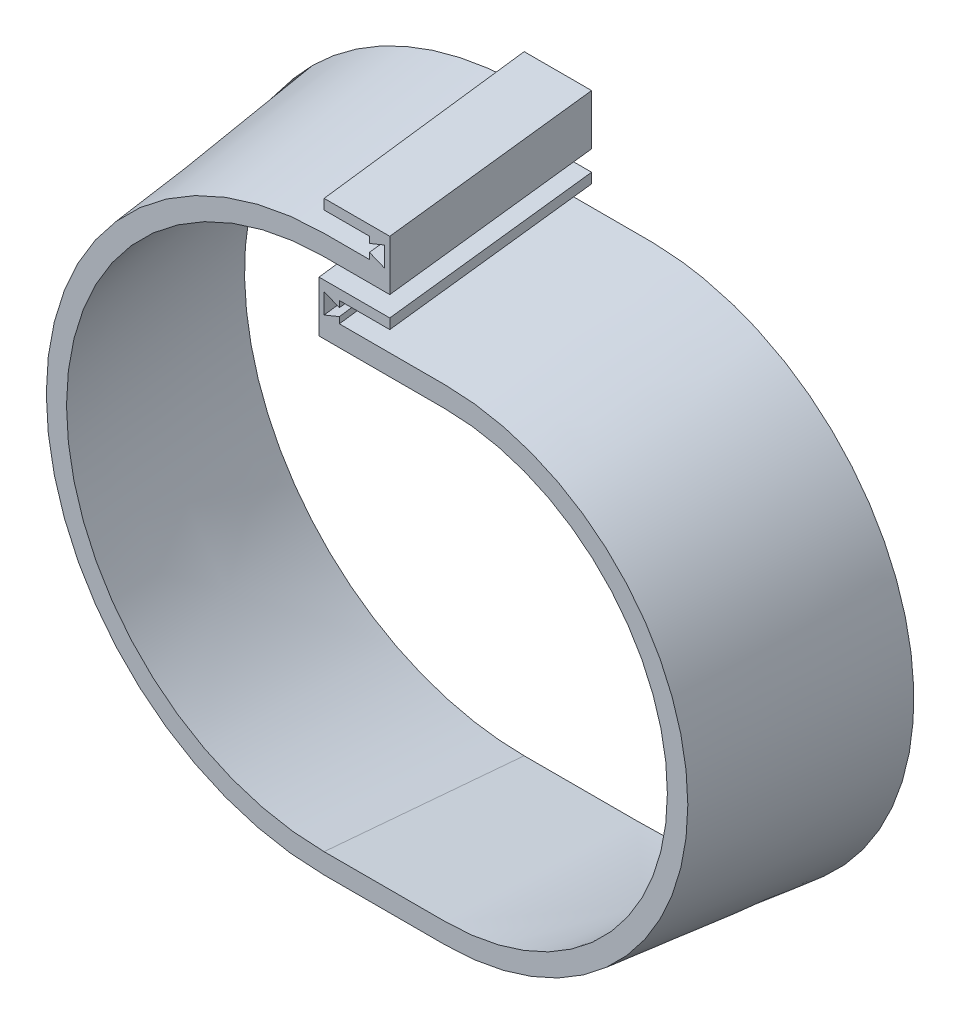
ISO-10303-21;
HEADER;
FILE_DESCRIPTION(('STEP AP214'),'2;1');
FILE_NAME('part.step','',(''),(''),'','','');
FILE_SCHEMA(('AUTOMOTIVE_DESIGN { 1 0 10303 214 1 1 1 1 }'));
ENDSEC;
DATA;
#1=APPLICATION_CONTEXT('core data for automotive mechanical design processes');
#2=APPLICATION_PROTOCOL_DEFINITION('international standard','automotive_design',2000,#1);
#3=PRODUCT_CONTEXT('',#1,'mechanical');
#4=PRODUCT('Part','Part','',(#3));
#5=PRODUCT_RELATED_PRODUCT_CATEGORY('part','',(#4));
#6=PRODUCT_DEFINITION_FORMATION('','',#4);
#7=PRODUCT_DEFINITION_CONTEXT('part definition',#1,'design');
#8=PRODUCT_DEFINITION('design','',#6,#7);
#9=PRODUCT_DEFINITION_SHAPE('','',#8);
#10=(LENGTH_UNIT() NAMED_UNIT(*) SI_UNIT(.MILLI.,.METRE.));
#11=(NAMED_UNIT(*) PLANE_ANGLE_UNIT() SI_UNIT($,.RADIAN.));
#12=(NAMED_UNIT(*) SI_UNIT($,.STERADIAN.) SOLID_ANGLE_UNIT());
#13=UNCERTAINTY_MEASURE_WITH_UNIT(LENGTH_MEASURE(1.E-05),#10,'distance_accuracy_value','');
#14=(GEOMETRIC_REPRESENTATION_CONTEXT(3) GLOBAL_UNCERTAINTY_ASSIGNED_CONTEXT((#13)) GLOBAL_UNIT_ASSIGNED_CONTEXT((#10,
#11,#12)) REPRESENTATION_CONTEXT('',''));
#15=CARTESIAN_POINT('',(0.,0.,0.));
#16=DIRECTION('',(0.,0.,1.));
#17=DIRECTION('',(1.,0.,0.));
#18=AXIS2_PLACEMENT_3D('',#15,#16,#17);
#19=CARTESIAN_POINT('',(0.,53.1735798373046,-203.2));
#20=CARTESIAN_POINT('',(0.,28.,0.));
#21=CARTESIAN_POINT('',(-0.668355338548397,53.1735798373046,-203.2));
#22=CARTESIAN_POINT('',(-0.500582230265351,28.,0.));
#23=CARTESIAN_POINT('',(-1.96098985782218,53.1735798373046,-203.2));
#24=CARTESIAN_POINT('',(-1.53725450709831,28.,0.));
#25=CARTESIAN_POINT('',(-3.86888532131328,53.1735798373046,-203.2));
#26=CARTESIAN_POINT('',(-3.12007524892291,28.,0.));
#27=CARTESIAN_POINT('',(-5.83422962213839,53.1735798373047,-203.2));
#28=CARTESIAN_POINT('',(-4.63550698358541,28.,0.));
#29=CARTESIAN_POINT('',(-7.25382722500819,53.1735798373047,-203.2));
#30=CARTESIAN_POINT('',(-5.56103893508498,28.,0.));
#31=CARTESIAN_POINT('',(-11.2539350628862,53.1735798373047,-203.2));
#32=CARTESIAN_POINT('',(-7.8151305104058,28.,0.));
#33=CARTESIAN_POINT('',(-17.7095674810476,52.5445178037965,-203.2));
#34=CARTESIAN_POINT('',(-11.4376437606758,27.6395927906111,0.));
#35=CARTESIAN_POINT('',(-27.0590501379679,49.7275389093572,-203.2));
#36=CARTESIAN_POINT('',(-16.6414565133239,26.0502756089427,0.));
#37=CARTESIAN_POINT('',(-35.706476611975,45.128848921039,-203.2));
#38=CARTESIAN_POINT('',(-21.4203750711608,23.4830088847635,0.));
#39=CARTESIAN_POINT('',(-43.3074213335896,38.9138126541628,-203.2));
#40=CARTESIAN_POINT('',(-25.5976422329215,20.0421946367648,0.));
#41=CARTESIAN_POINT('',(-49.5559760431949,31.3165376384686,-203.2));
#42=CARTESIAN_POINT('',(-29.0201461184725,15.8625819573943,0.));
#43=CARTESIAN_POINT('',(-54.1992552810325,22.6301976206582,-203.2));
#44=CARTESIAN_POINT('',(-31.5630913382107,11.1040231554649,0.));
#45=CARTESIAN_POINT('',(-57.0490058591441,13.1949083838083,-203.2));
#46=CARTESIAN_POINT('',(-33.1339162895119,5.94615417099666,0.));
#47=CARTESIAN_POINT('',(-57.9904942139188,3.38286307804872,-203.199999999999));
#48=CARTESIAN_POINT('',(-33.6750148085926,0.58215672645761,0.));
#49=CARTESIAN_POINT('',(-56.98772972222,-6.41800723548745,-203.200000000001));
#50=CARTESIAN_POINT('',(-33.1656164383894,-4.78745043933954,0.));
#51=CARTESIAN_POINT('',(-54.0849788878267,-15.8212241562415,-203.199999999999));
#52=CARTESIAN_POINT('',(-31.622450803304,-9.96149225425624,0.));
#53=CARTESIAN_POINT('',(-49.404317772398,-24.4587969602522,-203.200000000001));
#54=CARTESIAN_POINT('',(-29.0994535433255,-14.7448497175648,0.));
#55=CARTESIAN_POINT('',(-43.1395687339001,-31.9971350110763,-203.199999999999));
#56=CARTESIAN_POINT('',(-25.6862293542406,-18.9548199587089,0.));
#57=CARTESIAN_POINT('',(-35.5467520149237,-38.1512246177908,-203.200000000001));
#58=CARTESIAN_POINT('',(-21.5056616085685,-22.4275623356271,0.));
#59=CARTESIAN_POINT('',(-26.9320551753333,-42.6959292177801,-203.199999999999));
#60=CARTESIAN_POINT('',(-16.7102229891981,-25.0237161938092,0.));
#61=CARTESIAN_POINT('',(-17.6371943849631,-45.4746877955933,-203.2));
#62=CARTESIAN_POINT('',(-11.4775173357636,-26.6340198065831,0.));
#63=CARTESIAN_POINT('',(-11.2288774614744,-46.0939689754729,-203.2));
#64=CARTESIAN_POINT('',(-7.82908836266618,-27.,0.));
#65=CARTESIAN_POINT('',(-6.48966406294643,-46.0939689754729,-203.2));
#66=CARTESIAN_POINT('',(-5.11687034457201,-27.,0.));
#67=CARTESIAN_POINT('',(-3.79854600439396,-46.0939689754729,-203.2));
#68=CARTESIAN_POINT('',(-3.1987814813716,-27.,0.));
#69=CARTESIAN_POINT('',(-0.0774074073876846,-46.0939689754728,-203.2));
#70=CARTESIAN_POINT('',(0.0552786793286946,-27.,0.));
#71=CARTESIAN_POINT('',(3.66042093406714,-46.093968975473,-203.2));
#72=CARTESIAN_POINT('',(3.27023010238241,-27.,0.));
#73=CARTESIAN_POINT('',(6.38305686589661,-46.0939689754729,-203.2));
#74=CARTESIAN_POINT('',(5.13970488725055,-27.,0.));
#75=CARTESIAN_POINT('',(10.9239496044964,-46.0939689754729,-203.2));
#76=CARTESIAN_POINT('',(7.605722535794,-27.,0.));
#77=CARTESIAN_POINT('',(16.8603246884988,-45.5237132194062,-203.2));
#78=CARTESIAN_POINT('',(10.8025449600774,-26.6759504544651,0.));
#79=CARTESIAN_POINT('',(25.4927860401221,-42.9522317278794,-203.2));
#80=CARTESIAN_POINT('',(15.376007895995,-25.2651000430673,0.));
#81=CARTESIAN_POINT('',(33.5111608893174,-38.7322106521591,-203.2));
#82=CARTESIAN_POINT('',(19.5524112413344,-22.9924446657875,0.));
#83=CARTESIAN_POINT('',(40.589628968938,-33.002474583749,-203.2));
#84=CARTESIAN_POINT('',(23.1919844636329,-19.9689868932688,0.));
#85=CARTESIAN_POINT('',(46.4340801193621,-25.9700844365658,-203.2));
#86=CARTESIAN_POINT('',(26.1549570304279,-16.3057292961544,0.));
#87=CARTESIAN_POINT('',(50.7975750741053,-17.9023266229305,-203.2));
#88=CARTESIAN_POINT('',(28.3524152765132,-12.1530396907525,0.));
#89=CARTESIAN_POINT('',(53.4933671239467,-9.11543073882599,-203.2));
#90=CARTESIAN_POINT('',(29.6954455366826,-7.66128589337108,0.));
#91=CARTESIAN_POINT('',(54.4051365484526,0.039939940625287,-203.2));
#92=CARTESIAN_POINT('',(30.1533536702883,-2.99999999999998,0.));
#93=CARTESIAN_POINT('',(53.4933671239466,9.19531062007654,-203.2));
#94=CARTESIAN_POINT('',(29.6954455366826,1.66128589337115,0.));
#95=CARTESIAN_POINT('',(50.7975750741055,17.982206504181,-203.2));
#96=CARTESIAN_POINT('',(28.3524152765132,6.15303969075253,0.));
#97=CARTESIAN_POINT('',(46.4340801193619,26.0499643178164,-203.2));
#98=CARTESIAN_POINT('',(26.1549570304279,10.3057292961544,0.));
#99=CARTESIAN_POINT('',(40.5896289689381,33.0823544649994,-203.2));
#100=CARTESIAN_POINT('',(23.1919844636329,13.9689868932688,0.));
#101=CARTESIAN_POINT('',(33.5111608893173,38.8120905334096,-203.2));
#102=CARTESIAN_POINT('',(19.5524112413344,16.9924446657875,0.));
#103=CARTESIAN_POINT('',(25.4927860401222,43.0321116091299,-203.2));
#104=CARTESIAN_POINT('',(15.376007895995,19.2651000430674,0.));
#105=CARTESIAN_POINT('',(16.8603246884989,45.6035931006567,-203.2));
#106=CARTESIAN_POINT('',(10.8025449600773,20.6759504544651,0.));
#107=CARTESIAN_POINT('',(10.9239496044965,46.1738488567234,-203.2));
#108=CARTESIAN_POINT('',(7.605722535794,21.,0.));
#109=CARTESIAN_POINT('',(6.3830568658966,46.1738488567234,-203.2));
#110=CARTESIAN_POINT('',(5.13970488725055,21.,0.));
#111=CARTESIAN_POINT('',(3.54311215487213,46.1738488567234,-203.2));
#112=CARTESIAN_POINT('',(3.31388734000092,21.,0.));
#113=CARTESIAN_POINT('',(-0.356364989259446,46.1738488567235,-203.2));
#114=CARTESIAN_POINT('',(0.279864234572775,21.,0.));
#115=CARTESIAN_POINT('',(-4.13175471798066,46.1738488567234,-203.2));
#116=CARTESIAN_POINT('',(-2.916691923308,21.,0.));
#117=CARTESIAN_POINT('',(-6.69842836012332,46.1738488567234,-203.2));
#118=CARTESIAN_POINT('',(-5.00058223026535,21.,0.));
#119=CARTESIAN_POINT('',(-8.03280693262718,46.1738488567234,-203.2));
#120=CARTESIAN_POINT('',(-6.,21.,0.));
#121=B_SPLINE_SURFACE_WITH_KNOTS('',3,1,((#19,#20),(#21,#22),(#23,#24),(#25,#26),(#27,#28),(#29,
#30),(#31,#32),(#33,#34),(#35,#36),(#37,#38),(#39,#40),(#41,#42),(#43,#44),(#45,#46),(#47,#48),
(#49,#50),(#51,#52),(#53,#54),(#55,#56),(#57,#58),(#59,#60),(#61,#62),(#63,#64),(#65,#66),(#67,
#68),(#69,#70),(#71,#72),(#73,#74),(#75,#76),(#77,#78),(#79,#80),(#81,#82),(#83,#84),(#85,#86),
(#87,#88),(#89,#90),(#91,#92),(#93,#94),(#95,#96),(#97,#98),(#99,#100),(#101,#102),(#103,#104),
(#105,#106),(#107,#108),(#109,#110),(#111,#112),(#113,#114),(#115,#116),(#117,#118),(#119,
#120)),.UNSPECIFIED.,.F.,.F.,.F.,(4,1,1,1,2,1,1,1,1,1,1,1,1,1,1,1,1,1,1,1,2,1,1,1,2,1,1,1,1,1,1,
1,1,1,1,1,1,1,1,1,2,1,1,1,4),(2,2),(0.,0.00686077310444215,0.0137215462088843,
0.0205823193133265,0.0274430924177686,0.0558128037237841,0.0841825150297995,0.112552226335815,
0.14092193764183,0.169291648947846,0.197661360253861,0.226031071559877,0.254400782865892,
0.282770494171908,0.311140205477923,0.339509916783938,0.367879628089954,0.396249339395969,
0.424619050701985,0.452988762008,0.481358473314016,0.495056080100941,0.508753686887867,
0.522451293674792,0.536148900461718,0.561715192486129,0.587281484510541,0.612847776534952,
0.638414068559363,0.663980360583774,0.689546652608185,0.715112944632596,0.740679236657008,
0.766245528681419,0.79181182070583,0.817378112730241,0.842944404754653,0.868510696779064,
0.894076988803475,0.919643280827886,0.945209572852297,0.958907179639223,0.972604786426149,
0.986302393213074,1.),(0.,1.),.UNSPECIFIED.);
#122=CARTESIAN_POINT('',(-6.20007942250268,23.4777410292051,-20.));
#123=CARTESIAN_POINT('',(-5.74408336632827,23.4777410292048,-20.));
#124=CARTESIAN_POINT('',(-5.28808731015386,23.4777410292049,-20.));
#125=CARTESIAN_POINT('',(-4.37365584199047,23.4777410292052,-20.));
#126=CARTESIAN_POINT('',(-3.91522043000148,23.4777410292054,-20.));
#127=CARTESIAN_POINT('',(-2.99640735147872,23.4777410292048,-20.));
#128=CARTESIAN_POINT('',(-2.53602968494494,23.4777410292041,-20.));
#129=CARTESIAN_POINT('',(-1.6138291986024,23.4777410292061,-20.));
#130=CARTESIAN_POINT('',(-1.15200637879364,23.4777410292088,-20.));
#131=CARTESIAN_POINT('',(-0.227412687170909,23.4777410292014,-20.));
#132=CARTESIAN_POINT('',(0.235358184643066,23.4777410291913,-20.));
#133=CARTESIAN_POINT('',(0.929739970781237,23.477741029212,-20.));
#134=CARTESIAN_POINT('',(1.16135088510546,23.4777410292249,-20.));
#135=CARTESIAN_POINT('',(1.62457270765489,23.4777410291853,-20.));
#136=CARTESIAN_POINT('',(1.85618361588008,23.4777410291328,-20.));
#137=CARTESIAN_POINT('',(2.32521984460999,23.4777410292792,-20.));
#138=CARTESIAN_POINT('',(2.5626451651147,23.4777410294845,-20.));
#139=CARTESIAN_POINT('',(3.03749582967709,23.4777410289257,-20.));
#140=CARTESIAN_POINT('',(3.27492117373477,23.4777410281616,-20.));
#141=CARTESIAN_POINT('',(3.74963683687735,23.477741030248,-20.));
#142=CARTESIAN_POINT('',(3.98692715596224,23.4777410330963,-20.));
#143=CARTESIAN_POINT('',(4.3428626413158,23.4777410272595,-20.));
#144=CARTESIAN_POINT('',(4.46150780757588,23.4777410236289,-20.));
#145=CARTESIAN_POINT('',(4.69879803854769,23.4777410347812,-20.));
#146=CARTESIAN_POINT('',(4.81744310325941,23.477741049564,-20.));
#147=CARTESIAN_POINT('',(5.05457226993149,23.4777410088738,-20.));
#148=CARTESIAN_POINT('',(5.17305637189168,23.477740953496,-20.));
#149=CARTESIAN_POINT('',(5.41002495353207,23.4777411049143,-20.));
#150=CARTESIAN_POINT('',(5.52850943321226,23.4777413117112,-20.));
#151=CARTESIAN_POINT('',(5.70623648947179,23.4777408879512,-20.));
#152=CARTESIAN_POINT('',(5.76547906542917,23.4777406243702,-20.));
#153=CARTESIAN_POINT('',(5.88396437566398,23.477741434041,-20.));
#154=CARTESIAN_POINT('',(5.94320710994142,23.4777425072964,-20.));
#155=CARTESIAN_POINT('',(6.03207103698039,23.4777402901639,-20.));
#156=CARTESIAN_POINT('',(6.06169222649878,23.4777389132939,-20.));
#157=CARTESIAN_POINT('',(6.12093460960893,23.4777431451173,-20.));
#158=CARTESIAN_POINT('',(6.15055580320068,23.4777487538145,-20.));
#159=CARTESIAN_POINT('',(6.20979807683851,23.477733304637,-20.));
#160=CARTESIAN_POINT('',(6.23941915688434,23.4777122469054,-20.));
#161=CARTESIAN_POINT('',(6.2986609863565,23.4775513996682,-20.));
#162=CARTESIAN_POINT('',(6.32828173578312,23.4774116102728,-20.));
#163=CARTESIAN_POINT('',(6.41697409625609,23.4768466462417,-20.));
#164=CARTESIAN_POINT('',(6.47604484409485,23.4762759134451,-20.));
#165=CARTESIAN_POINT('',(6.59418127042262,23.474729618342,-20.));
#166=CARTESIAN_POINT('',(6.65324694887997,23.4737540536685,-20.));
#167=CARTESIAN_POINT('',(6.83043198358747,23.4702265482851,-20.));
#168=CARTESIAN_POINT('',(6.94853993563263,23.4670737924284,-20.));
#169=CARTESIAN_POINT('',(7.18469655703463,23.459165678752,-20.));
#170=CARTESIAN_POINT('',(7.30274522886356,23.4544103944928,-20.));
#171=CARTESIAN_POINT('',(7.53876712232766,23.4433006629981,-20.));
#172=CARTESIAN_POINT('',(7.65674034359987,23.4369462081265,-20.));
#173=CARTESIAN_POINT('',(8.01004504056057,23.4155160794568,-20.));
#174=CARTESIAN_POINT('',(8.24523662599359,23.3980577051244,-20.));
#175=CARTESIAN_POINT('',(8.71507364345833,23.3568001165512,-20.));
#176=CARTESIAN_POINT('',(8.94971904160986,23.3330005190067,-20.));
#177=CARTESIAN_POINT('',(9.4183194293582,23.2790787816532,-20.));
#178=CARTESIAN_POINT('',(9.65227431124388,23.2489557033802,-20.));
#179=CARTESIAN_POINT('',(10.1192729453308,23.1824152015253,-20.));
#180=CARTESIAN_POINT('',(10.3523167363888,23.1459980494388,-20.));
#181=CARTESIAN_POINT('',(10.9482344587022,23.0446206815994,-20.));
#182=CARTESIAN_POINT('',(11.3103484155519,22.9751325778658,-20.));
#183=CARTESIAN_POINT('',(12.0318853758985,22.8208182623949,-20.));
#184=CARTESIAN_POINT('',(12.3913031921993,22.7359678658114,-20.));
#185=CARTESIAN_POINT('',(13.1065362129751,22.551093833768,-20.));
#186=CARTESIAN_POINT('',(13.4623481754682,22.4510576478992,-20.));
#187=CARTESIAN_POINT('',(14.1694526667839,22.2360147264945,-20.));
#188=CARTESIAN_POINT('',(14.5207448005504,22.1210066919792,-20.));
#189=CARTESIAN_POINT('',(15.2153475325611,21.8771758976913,-20.));
#190=CARTESIAN_POINT('',(15.5586994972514,21.7484709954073,-20.));
#191=CARTESIAN_POINT('',(16.2394828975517,21.4767136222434,-20.));
#192=CARTESIAN_POINT('',(16.5769171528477,21.3336682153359,-20.));
#193=CARTESIAN_POINT('',(17.24535998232,21.0334908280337,-20.));
#194=CARTESIAN_POINT('',(17.5763701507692,20.8763623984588,-20.));
#195=CARTESIAN_POINT('',(18.231484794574,20.5483584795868,-20.));
#196=CARTESIAN_POINT('',(18.555589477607,20.3774834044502,-20.));
#197=CARTESIAN_POINT('',(19.3040882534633,19.9626106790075,-20.));
#198=CARTESIAN_POINT('',(19.7255736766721,19.7133405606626,-20.));
#199=CARTESIAN_POINT('',(20.5540383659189,19.1916380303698,-20.));
#200=CARTESIAN_POINT('',(20.9610151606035,18.9192016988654,-20.));
#201=CARTESIAN_POINT('',(21.7591577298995,18.3520279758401,-20.));
#202=CARTESIAN_POINT('',(22.1503227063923,18.0572894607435,-20.));
#203=CARTESIAN_POINT('',(22.9168551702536,17.4453814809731,-20.));
#204=CARTESIAN_POINT('',(23.2921649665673,17.1281397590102,-20.));
#205=CARTESIAN_POINT('',(24.0242968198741,16.4730168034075,-20.));
#206=CARTESIAN_POINT('',(24.3811200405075,16.1351368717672,-20.));
#207=CARTESIAN_POINT('',(25.0749475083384,15.4396884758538,-20.));
#208=CARTESIAN_POINT('',(25.4119523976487,15.082120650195,-20.));
#209=CARTESIAN_POINT('',(26.2284324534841,14.1652685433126,-20.));
#210=CARTESIAN_POINT('',(26.6950449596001,13.5943951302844,-20.));
#211=CARTESIAN_POINT('',(27.3576103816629,12.7104459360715,-20.));
#212=CARTESIAN_POINT('',(27.5722560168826,12.4111640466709,-20.));
#213=CARTESIAN_POINT('',(27.9888448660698,11.803767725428,-20.));
#214=CARTESIAN_POINT('',(28.1907849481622,11.4956511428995,-20.));
#215=CARTESIAN_POINT('',(28.7763856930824,10.559830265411,-20.));
#216=CARTESIAN_POINT('',(29.1405010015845,9.91975502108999,-20.));
#217=CARTESIAN_POINT('',(29.8135971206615,8.61124010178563,-20.));
#218=CARTESIAN_POINT('',(30.1225791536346,7.94280105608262,-20.));
#219=CARTESIAN_POINT('',(30.5427441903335,6.92195705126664,-20.));
#220=CARTESIAN_POINT('',(30.6756676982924,6.57837045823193,-20.));
#221=CARTESIAN_POINT('',(30.9268113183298,5.8859652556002,-20.));
#222=CARTESIAN_POINT('',(31.0450350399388,5.53714795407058,-20.));
#223=CARTESIAN_POINT('',(31.3775132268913,4.48357550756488,-20.));
#224=CARTESIAN_POINT('',(31.5695842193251,3.77167669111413,-20.));
#225=CARTESIAN_POINT('',(31.8933321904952,2.33412669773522,-20.));
#226=CARTESIAN_POINT('',(32.0249866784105,1.60847050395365,-20.));
#227=CARTESIAN_POINT('',(32.2268674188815,0.148572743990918,-20.));
#228=CARTESIAN_POINT('',(32.2970969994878,-0.585668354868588,-20.));
#229=CARTESIAN_POINT('',(32.3557098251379,-1.68929823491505,-20.));
#230=CARTESIAN_POINT('',(32.3674579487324,-2.0575813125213,-20.));
#231=CARTESIAN_POINT('',(32.37525580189,-2.7943137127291,-20.));
#232=CARTESIAN_POINT('',(32.3713055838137,-3.16276303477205,-20.));
#233=CARTESIAN_POINT('',(32.3359915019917,-4.26735056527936,-20.));
#234=CARTESIAN_POINT('',(32.2811716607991,-5.00286923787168,-20.));
#235=CARTESIAN_POINT('',(32.1099234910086,-6.46641350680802,-20.));
#236=CARTESIAN_POINT('',(31.9935104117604,-7.19444091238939,-20.));
#237=CARTESIAN_POINT('',(31.6999994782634,-8.63815068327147,-20.));
#238=CARTESIAN_POINT('',(31.52290226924,-9.35383317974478,-20.));
#239=CARTESIAN_POINT('',(31.1093423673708,-10.7670912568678,-20.));
#240=CARTESIAN_POINT('',(30.8729448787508,-11.4646858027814,-20.));
#241=CARTESIAN_POINT('',(30.4746894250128,-12.4939900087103,-20.));
#242=CARTESIAN_POINT('',(30.3346438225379,-12.8342788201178,-20.));
#243=CARTESIAN_POINT('',(30.0402302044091,-13.5086035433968,-20.));
#244=CARTESIAN_POINT('',(29.885862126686,-13.8426394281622,-20.));
#245=CARTESIAN_POINT('',(29.4017329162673,-14.8347047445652,-20.));
#246=CARTESIAN_POINT('',(29.0509701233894,-15.4826316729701,-20.));
#247=CARTESIAN_POINT('',(28.2963767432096,-16.7466938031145,-20.));
#248=CARTESIAN_POINT('',(27.8925458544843,-17.3628288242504,-20.));
#249=CARTESIAN_POINT('',(27.0347753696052,-18.55885817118,-20.));
#250=CARTESIAN_POINT('',(26.5808544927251,-19.1387659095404,-20.));
#251=CARTESIAN_POINT('',(25.6256991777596,-20.2583024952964,-20.));
#252=CARTESIAN_POINT('',(25.1244615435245,-20.7979286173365,-20.));
#253=CARTESIAN_POINT('',(24.0780620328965,-21.8324566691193,-20.));
#254=CARTESIAN_POINT('',(23.5329113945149,-22.3273699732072,-20.));
#255=CARTESIAN_POINT('',(22.403115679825,-23.2695167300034,-20.));
#256=CARTESIAN_POINT('',(21.8184841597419,-23.7167664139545,-20.));
#257=CARTESIAN_POINT('',(20.8146502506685,-24.4200532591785,-20.));
#258=CARTESIAN_POINT('',(20.4052180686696,-24.6901553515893,-20.));
#259=CARTESIAN_POINT('',(19.5717473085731,-25.2071490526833,-20.));
#260=CARTESIAN_POINT('',(19.147704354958,-25.4540336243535,-20.));
#261=CARTESIAN_POINT('',(18.2859333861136,-25.923939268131,-20.));
#262=CARTESIAN_POINT('',(17.8481893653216,-26.1469309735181,-20.));
#263=CARTESIAN_POINT('',(16.9612436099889,-26.5676584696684,-20.));
#264=CARTESIAN_POINT('',(16.5120534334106,-26.7654186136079,-20.));
#265=CARTESIAN_POINT('',(15.603572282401,-27.1350143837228,-20.));
#266=CARTESIAN_POINT('',(15.1442901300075,-27.3068716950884,-20.));
#267=CARTESIAN_POINT('',(14.2182882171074,-27.6239940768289,-20.));
#268=CARTESIAN_POINT('',(13.7515969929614,-27.7693425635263,-20.));
#269=CARTESIAN_POINT('',(12.7527085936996,-28.050074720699,-20.));
#270=CARTESIAN_POINT('',(12.219539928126,-28.1820104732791,-20.));
#271=CARTESIAN_POINT('',(11.1458214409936,-28.4121615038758,-20.));
#272=CARTESIAN_POINT('',(10.6052700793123,-28.5103696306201,-20.));
#273=CARTESIAN_POINT('',(9.79015611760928,-28.6321740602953,-20.));
#274=CARTESIAN_POINT('',(9.51744346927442,-28.6685494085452,-20.));
#275=CARTESIAN_POINT('',(8.97098846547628,-28.7327085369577,-20.));
#276=CARTESIAN_POINT('',(8.69724609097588,-28.7604921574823,-20.));
#277=CARTESIAN_POINT('',(8.28555712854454,-28.7957385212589,-20.));
#278=CARTESIAN_POINT('',(8.14787830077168,-28.8064303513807,-20.));
#279=CARTESIAN_POINT('',(7.87236434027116,-28.8256353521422,-20.));
#280=CARTESIAN_POINT('',(7.73452920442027,-28.8341484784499,-20.));
#281=CARTESIAN_POINT('',(7.45875207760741,-28.8489908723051,-20.));
#282=CARTESIAN_POINT('',(7.32081009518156,-28.8553202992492,-20.));
#283=CARTESIAN_POINT('',(7.04484922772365,-28.8657911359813,-20.));
#284=CARTESIAN_POINT('',(6.90683034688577,-28.8699326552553,-20.));
#285=CARTESIAN_POINT('',(6.69947187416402,-28.8745095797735,-20.));
#286=CARTESIAN_POINT('',(6.63014939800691,-28.8757635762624,-20.));
#287=CARTESIAN_POINT('',(6.49149703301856,-28.8777159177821,-20.));
#288=CARTESIAN_POINT('',(6.42216714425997,-28.8784142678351,-20.));
#289=CARTESIAN_POINT('',(6.31816840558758,-28.8790544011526,-20.));
#290=CARTESIAN_POINT('',(6.28350070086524,-28.8791998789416,-20.));
#291=CARTESIAN_POINT('',(6.21416497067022,-28.8793383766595,-20.));
#292=CARTESIAN_POINT('',(6.17949694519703,-28.8793313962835,-20.));
#293=CARTESIAN_POINT('',(6.07549258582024,-28.8793201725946,-20.));
#294=CARTESIAN_POINT('',(6.00615631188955,-28.8793256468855,-20.));
#295=CARTESIAN_POINT('',(5.86747919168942,-28.8793296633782,-20.));
#296=CARTESIAN_POINT('',(5.79813834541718,-28.8793282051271,-20.));
#297=CARTESIAN_POINT('',(5.6594568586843,-28.8793271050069,-20.));
#298=CARTESIAN_POINT('',(5.59011621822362,-28.8793274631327,-20.));
#299=CARTESIAN_POINT('',(5.38209723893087,-28.8793280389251,-20.));
#300=CARTESIAN_POINT('',(5.24341889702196,-28.8793277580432,-20.));
#301=CARTESIAN_POINT('',(4.96618394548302,-28.8793275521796,-20.));
#302=CARTESIAN_POINT('',(4.82762733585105,-28.8793276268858,-20.));
#303=CARTESIAN_POINT('',(4.55051327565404,-28.8793276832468,-20.));
#304=CARTESIAN_POINT('',(4.411955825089,-28.8793276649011,-20.));
#305=CARTESIAN_POINT('',(3.99629489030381,-28.8793276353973,-20.));
#306=CARTESIAN_POINT('',(3.71919140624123,-28.879327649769,-20.));
#307=CARTESIAN_POINT('',(3.16191805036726,-28.879327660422,-20.));
#308=CARTESIAN_POINT('',(2.88174817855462,-28.8793276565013,-20.));
#309=CARTESIAN_POINT('',(2.3214055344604,-28.8793276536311,-20.));
#310=CARTESIAN_POINT('',(2.04123276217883,-28.8793276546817,-20.));
#311=CARTESIAN_POINT('',(1.48162895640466,-28.8793276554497,-20.));
#312=CARTESIAN_POINT('',(1.20219792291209,-28.8793276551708,-20.));
#313=CARTESIAN_POINT('',(0.643336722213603,-28.8793276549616,-20.));
#314=CARTESIAN_POINT('',(0.363906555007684,-28.8793276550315,-20.));
#315=CARTESIAN_POINT('',(-0.194437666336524,-28.8793276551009,-20.));
#316=CARTESIAN_POINT('',(-0.473351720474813,-28.8793276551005,-20.));
#317=CARTESIAN_POINT('',(-1.03118040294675,-28.8793276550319,-20.));
#318=CARTESIAN_POINT('',(-1.3100950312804,-28.8793276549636,-20.));
#319=CARTESIAN_POINT('',(-1.86763291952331,-28.8793276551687,-20.));
#320=CARTESIAN_POINT('',(-2.14625617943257,-28.8793276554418,-20.));
#321=CARTESIAN_POINT('',(-2.70350126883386,-28.8793276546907,-20.));
#322=CARTESIAN_POINT('',(-2.98212309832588,-28.8793276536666,-20.));
#323=CARTESIAN_POINT('',(-3.53929756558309,-28.8793276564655,-20.));
#324=CARTESIAN_POINT('',(-3.81785020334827,-28.8793276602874,-20.));
#325=CARTESIAN_POINT('',(-4.23568198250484,-28.8793276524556,-20.));
#326=CARTESIAN_POINT('',(-4.37496112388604,-28.8793276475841,-20.));
#327=CARTESIAN_POINT('',(-4.65351890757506,-28.8793276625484,-20.));
#328=CARTESIAN_POINT('',(-4.79279754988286,-28.8793276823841,-20.));
#329=CARTESIAN_POINT('',(-5.07143563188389,-28.8793276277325,-20.));
#330=CARTESIAN_POINT('',(-5.21079507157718,-28.8793275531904,-20.));
#331=CARTESIAN_POINT('',(-5.4198351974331,-28.8793277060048,-20.));
#332=CARTESIAN_POINT('',(-5.48951588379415,-28.8793278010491,-20.));
#333=CARTESIAN_POINT('',(-5.62887718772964,-28.8793275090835,-20.));
#334=CARTESIAN_POINT('',(-5.69855780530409,-28.8793271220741,-20.));
#335=CARTESIAN_POINT('',(-5.83791618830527,-28.8793281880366,-20.));
#336=CARTESIAN_POINT('',(-5.90759395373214,-28.8793296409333,-20.));
#337=CARTESIAN_POINT('',(-6.01211072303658,-28.8793266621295,-20.));
#338=CARTESIAN_POINT('',(-6.04694972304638,-28.8793248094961,-20.));
#339=CARTESIAN_POINT('',(-6.11662774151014,-28.879330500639,-20.));
#340=CARTESIAN_POINT('',(-6.15146675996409,-28.8793380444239,-20.));
#341=CARTESIAN_POINT('',(-6.2211440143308,-28.879317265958,-20.));
#342=CARTESIAN_POINT('',(-6.25598225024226,-28.8792889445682,-20.));
#343=CARTESIAN_POINT('',(-6.32565826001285,-28.879088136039,-20.));
#344=CARTESIAN_POINT('',(-6.36049603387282,-28.8789156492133,-20.));
#345=CARTESIAN_POINT('',(-6.4650075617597,-28.8782194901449,-20.));
#346=CARTESIAN_POINT('',(-6.53468017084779,-28.8775171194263,-20.));
#347=CARTESIAN_POINT('',(-6.68835518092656,-28.8754215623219,-20.));
#348=CARTESIAN_POINT('',(-6.77235607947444,-28.8739159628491,-20.));
#349=CARTESIAN_POINT('',(-6.94034312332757,-28.8701920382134,-20.));
#350=CARTESIAN_POINT('',(-7.02432926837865,-28.8679737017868,-20.));
#351=CARTESIAN_POINT('',(-7.27625472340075,-28.8602479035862,-20.));
#352=CARTESIAN_POINT('',(-7.44416251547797,-28.8536696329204,-20.));
#353=CARTESIAN_POINT('',(-7.77974321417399,-28.8376682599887,-20.));
#354=CARTESIAN_POINT('',(-7.94741620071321,-28.8282468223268,-20.));
#355=CARTESIAN_POINT('',(-8.28257976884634,-28.8065619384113,-20.));
#356=CARTESIAN_POINT('',(-8.45007034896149,-28.7942984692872,-20.));
#357=CARTESIAN_POINT('',(-8.78475577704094,-28.7669394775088,-20.));
#358=CARTESIAN_POINT('',(-8.95195071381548,-28.7518450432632,-20.));
#359=CARTESIAN_POINT('',(-9.28605821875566,-28.7188261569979,-20.));
#360=CARTESIAN_POINT('',(-9.452970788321,-28.7009017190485,-20.));
#361=CARTESIAN_POINT('',(-9.95315186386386,-28.6428970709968,-20.));
#362=CARTESIAN_POINT('',(-10.2859394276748,-28.5985793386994,-20.));
#363=CARTESIAN_POINT('',(-10.949812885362,-28.4986860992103,-20.));
#364=CARTESIAN_POINT('',(-11.2808987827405,-28.4431106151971,-20.));
#365=CARTESIAN_POINT('',(-11.9367461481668,-28.3215189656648,-20.));
#366=CARTESIAN_POINT('',(-12.2615341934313,-28.2556462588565,-20.));
#367=CARTESIAN_POINT('',(-12.9089898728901,-28.1129779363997,-20.));
#368=CARTESIAN_POINT('',(-13.2316554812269,-28.0361731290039,-20.));
#369=CARTESIAN_POINT('',(-13.8744114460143,-27.8717524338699,-20.));
#370=CARTESIAN_POINT('',(-14.1945002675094,-27.7841305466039,-20.));
#371=CARTESIAN_POINT('',(-14.8316506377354,-27.5981919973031,-20.));
#372=CARTESIAN_POINT('',(-15.1487113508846,-27.4998724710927,-20.));
#373=CARTESIAN_POINT('',(-15.779351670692,-27.292671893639,-20.));
#374=CARTESIAN_POINT('',(-16.0929313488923,-27.1837910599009,-20.));
#375=CARTESIAN_POINT('',(-16.7950712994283,-26.9267223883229,-20.));
#376=CARTESIAN_POINT('',(-17.1825454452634,-26.7755562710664,-20.));
#377=CARTESIAN_POINT('',(-17.9505964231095,-26.4571061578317,-20.));
#378=CARTESIAN_POINT('',(-18.3311763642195,-26.2898296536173,-20.));
#379=CARTESIAN_POINT('',(-19.0848839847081,-25.9394818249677,-20.));
#380=CARTESIAN_POINT('',(-19.4580134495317,-25.7564143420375,-20.));
#381=CARTESIAN_POINT('',(-20.1962565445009,-25.3748041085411,-20.));
#382=CARTESIAN_POINT('',(-20.5613704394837,-25.1762618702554,-20.));
#383=CARTESIAN_POINT('',(-21.2857338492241,-24.7624562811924,-20.));
#384=CARTESIAN_POINT('',(-21.644916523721,-24.5470759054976,-20.));
#385=CARTESIAN_POINT('',(-22.3539033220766,-24.1012581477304,-20.));
#386=CARTESIAN_POINT('',(-22.7037057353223,-23.8708180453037,-20.));
#387=CARTESIAN_POINT('',(-23.393252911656,-23.3952785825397,-20.));
#388=CARTESIAN_POINT('',(-23.7329966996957,-23.1501778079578,-20.));
#389=CARTESIAN_POINT('',(-24.4018110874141,-22.6458326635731,-20.));
#390=CARTESIAN_POINT('',(-24.7308815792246,-22.3865881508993,-20.));
#391=CARTESIAN_POINT('',(-25.4844966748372,-21.7666331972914,-20.));
#392=CARTESIAN_POINT('',(-25.9047300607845,-21.4006603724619,-20.));
#393=CARTESIAN_POINT('',(-26.7238977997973,-20.6456848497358,-20.));
#394=CARTESIAN_POINT('',(-27.1228336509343,-20.2566837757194,-20.));
#395=CARTESIAN_POINT('',(-27.8981216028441,-19.4568017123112,-20.));
#396=CARTESIAN_POINT('',(-28.2744741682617,-19.0459211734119,-20.));
#397=CARTESIAN_POINT('',(-29.0024248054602,-18.2049061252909,-20.));
#398=CARTESIAN_POINT('',(-29.3540923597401,-17.7748317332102,-20.));
#399=CARTESIAN_POINT('',(-30.0328002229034,-16.8956422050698,-20.));
#400=CARTESIAN_POINT('',(-30.359839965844,-16.4465266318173,-20.));
#401=CARTESIAN_POINT('',(-30.9881323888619,-15.5306371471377,-20.));
#402=CARTESIAN_POINT('',(-31.2893849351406,-15.0638631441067,-20.));
#403=CARTESIAN_POINT('',(-32.009589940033,-13.8760331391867,-20.));
#404=CARTESIAN_POINT('',(-32.4118602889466,-13.1447832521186,-20.));
#405=CARTESIAN_POINT('',(-33.1535711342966,-11.650905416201,-20.));
#406=CARTESIAN_POINT('',(-33.4930024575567,-10.8882729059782,-20.));
#407=CARTESIAN_POINT('',(-33.9530551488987,-9.72466891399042,-20.));
#408=CARTESIAN_POINT('',(-34.0982994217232,-9.33327306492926,-20.));
#409=CARTESIAN_POINT('',(-34.3721303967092,-8.54482587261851,-20.));
#410=CARTESIAN_POINT('',(-34.5007229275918,-8.14777656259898,-20.));
#411=CARTESIAN_POINT('',(-34.7410773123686,-7.34861144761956,-20.));
#412=CARTESIAN_POINT('',(-34.8528389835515,-6.94649558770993,-20.));
#413=CARTESIAN_POINT('',(-35.0593595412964,-6.13780214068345,-20.));
#414=CARTESIAN_POINT('',(-35.1541127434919,-5.73122310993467,-20.));
#415=CARTESIAN_POINT('',(-35.4124121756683,-4.50613274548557,-20.));
#416=CARTESIAN_POINT('',(-35.5500742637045,-3.68201546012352,-20.));
#417=CARTESIAN_POINT('',(-35.755530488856,-2.0251452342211,-20.));
#418=CARTESIAN_POINT('',(-35.8233258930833,-1.19239245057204,-20.));
#419=CARTESIAN_POINT('',(-35.8722420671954,0.058551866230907,-20.));
#420=CARTESIAN_POINT('',(-35.8797508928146,0.475844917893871,-20.));
#421=CARTESIAN_POINT('',(-35.8771187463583,1.3103651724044,-20.));
#422=CARTESIAN_POINT('',(-35.8669776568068,1.72759237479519,-20.));
#423=CARTESIAN_POINT('',(-35.8101665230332,2.97809730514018,-20.));
#424=CARTESIAN_POINT('',(-35.7371159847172,3.8103880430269,-20.));
#425=CARTESIAN_POINT('',(-35.575284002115,5.05163826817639,-20.));
#426=CARTESIAN_POINT('',(-35.5126248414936,5.46421742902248,-20.));
#427=CARTESIAN_POINT('',(-35.369945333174,6.28637297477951,-20.));
#428=CARTESIAN_POINT('',(-35.2899250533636,6.69594937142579,-20.));
#429=CARTESIAN_POINT('',(-35.0240123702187,7.91901891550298,-20.));
#430=CARTESIAN_POINT('',(-34.8122442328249,8.72703559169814,-20.));
#431=CARTESIAN_POINT('',(-34.3216220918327,10.3221382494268,-20.));
#432=CARTESIAN_POINT('',(-34.0427830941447,11.1092288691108,-20.));
#433=CARTESIAN_POINT('',(-33.4196498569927,12.6570598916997,-20.));
#434=CARTESIAN_POINT('',(-33.0753557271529,13.4178003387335,-20.));
#435=CARTESIAN_POINT('',(-32.3241817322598,14.9072528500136,-20.));
#436=CARTESIAN_POINT('',(-31.9173400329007,15.6359840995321,-20.));
#437=CARTESIAN_POINT('',(-31.2622958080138,16.7012717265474,-20.));
#438=CARTESIAN_POINT('',(-31.036466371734,17.051756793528,-20.));
#439=CARTESIAN_POINT('',(-30.570173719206,17.7429251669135,-20.));
#440=CARTESIAN_POINT('',(-30.329708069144,18.0836068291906,-20.));
#441=CARTESIAN_POINT('',(-29.5868005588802,19.0904010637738,-20.));
#442=CARTESIAN_POINT('',(-29.0630003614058,19.741015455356,-20.));
#443=CARTESIAN_POINT('',(-28.2377418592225,20.6820832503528,-20.));
#444=CARTESIAN_POINT('',(-27.9559541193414,20.9900681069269,-20.));
#445=CARTESIAN_POINT('',(-27.3796215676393,21.5938612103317,-20.));
#446=CARTESIAN_POINT('',(-27.0850771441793,21.8896698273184,-20.));
#447=CARTESIAN_POINT('',(-26.1826379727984,22.7584597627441,-20.));
#448=CARTESIAN_POINT('',(-25.556258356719,23.3124391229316,-20.));
#449=CARTESIAN_POINT('',(-24.2591986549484,24.3656291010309,-20.));
#450=CARTESIAN_POINT('',(-23.5885240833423,24.8648465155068,-20.));
#451=CARTESIAN_POINT('',(-22.4387028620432,25.6473869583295,-20.));
#452=CARTESIAN_POINT('',(-21.9705889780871,25.9470429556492,-20.));
#453=CARTESIAN_POINT('',(-21.0182833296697,26.5196194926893,-20.));
#454=CARTESIAN_POINT('',(-20.5340921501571,26.7925410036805,-20.));
#455=CARTESIAN_POINT('',(-19.5512450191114,27.3107924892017,-20.));
#456=CARTESIAN_POINT('',(-19.0525912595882,27.5561266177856,-20.));
#457=CARTESIAN_POINT('',(-18.1688385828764,27.9605148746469,-20.));
#458=CARTESIAN_POINT('',(-17.7865723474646,28.1257907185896,-20.));
#459=CARTESIAN_POINT('',(-17.0153884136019,28.4400752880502,-20.));
#460=CARTESIAN_POINT('',(-16.6264705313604,28.5890835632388,-20.));
#461=CARTESIAN_POINT('',(-15.8426348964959,28.8706433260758,-20.));
#462=CARTESIAN_POINT('',(-15.4477159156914,29.0031913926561,-20.));
#463=CARTESIAN_POINT('',(-14.6525049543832,29.2516233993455,-20.));
#464=CARTESIAN_POINT('',(-14.2522109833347,29.3675009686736,-20.));
#465=CARTESIAN_POINT('',(-13.4453656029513,29.5827839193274,-20.));
#466=CARTESIAN_POINT('',(-13.0387946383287,29.6821160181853,-20.));
#467=CARTESIAN_POINT('',(-12.2218371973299,29.8634584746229,-20.));
#468=CARTESIAN_POINT('',(-11.8114510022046,29.9454700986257,-20.));
#469=CARTESIAN_POINT('',(-10.987805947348,30.0919929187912,-20.));
#470=CARTESIAN_POINT('',(-10.5745488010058,30.1565137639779,-20.));
#471=CARTESIAN_POINT('',(-9.74609491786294,30.2679992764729,-20.));
#472=CARTESIAN_POINT('',(-9.33090065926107,30.3149822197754,-20.));
#473=CARTESIAN_POINT('',(-8.76627720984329,30.3668484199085,-20.));
#474=CARTESIAN_POINT('',(-8.61752081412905,30.3793836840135,-20.));
#475=CARTESIAN_POINT('',(-8.31983314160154,30.4022116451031,-20.));
#476=CARTESIAN_POINT('',(-8.17090186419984,30.4125043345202,-20.));
#477=CARTESIAN_POINT('',(-7.87290732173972,30.4308431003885,-20.));
#478=CARTESIAN_POINT('',(-7.72384406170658,30.438889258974,-20.));
#479=CARTESIAN_POINT('',(-7.4256158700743,30.452732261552,-20.));
#480=CARTESIAN_POINT('',(-7.27645094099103,30.458529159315,-20.));
#481=CARTESIAN_POINT('',(-7.05260699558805,30.465536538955,-20.));
#482=CARTESIAN_POINT('',(-6.97795347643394,30.4675913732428,-20.));
#483=CARTESIAN_POINT('',(-6.82863332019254,30.4711370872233,-20.));
#484=CARTESIAN_POINT('',(-6.7539666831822,30.4726279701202,-20.));
#485=CARTESIAN_POINT('',(-6.60462241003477,30.4750444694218,-20.));
#486=CARTESIAN_POINT('',(-6.5299447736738,30.4759700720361,-20.));
#487=CARTESIAN_POINT('',(-6.41792465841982,30.4769368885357,-20.));
#488=CARTESIAN_POINT('',(-6.38058389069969,30.4771888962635,-20.));
#489=CARTESIAN_POINT('',(-6.30590160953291,30.4775477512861,-20.));
#490=CARTESIAN_POINT('',(-6.26856009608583,30.4776545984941,-20.));
#491=CARTESIAN_POINT('',(-6.1938503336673,30.4777417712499,-20.));
#492=CARTESIAN_POINT('',(-6.15648208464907,30.4777220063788,-20.));
#493=CARTESIAN_POINT('',(-6.08174560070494,30.4777070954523,-20.));
#494=CARTESIAN_POINT('',(-6.04437736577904,30.4777119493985,-20.));
#495=CARTESIAN_POINT('',(-5.93227276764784,30.4777197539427,-20.));
#496=CARTESIAN_POINT('',(-5.85753639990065,30.477715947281,-20.));
#497=CARTESIAN_POINT('',(-5.70806428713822,30.4777131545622,-20.));
#498=CARTESIAN_POINT('',(-5.63332854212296,30.4777141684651,-20.));
#499=CARTESIAN_POINT('',(-5.48385702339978,30.4777149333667,-20.));
#500=CARTESIAN_POINT('',(-5.40912124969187,30.477714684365,-20.));
#501=CARTESIAN_POINT('',(-5.18488642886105,30.4777142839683,-20.));
#502=CARTESIAN_POINT('',(-5.03538738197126,30.4777144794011,-20.));
#503=CARTESIAN_POINT('',(-4.73638893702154,30.4777146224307,-20.));
#504=CARTESIAN_POINT('',(-4.58688953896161,30.4777145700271,-20.));
#505=CARTESIAN_POINT('',(-4.28925711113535,30.4777145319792,-20.));
#506=CARTESIAN_POINT('',(-4.14112408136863,30.4777145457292,-20.));
#507=CARTESIAN_POINT('',(-3.84485811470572,30.4777145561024,-20.));
#508=CARTESIAN_POINT('',(-3.69672517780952,30.4777145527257,-20.));
#509=CARTESIAN_POINT('',(-3.25242583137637,30.4777145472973,-20.));
#510=CARTESIAN_POINT('',(-2.95625942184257,30.477714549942,-20.));
#511=CARTESIAN_POINT('',(-2.3641465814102,30.4777145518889,-20.));
#512=CARTESIAN_POINT('',(-2.06820015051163,30.4777145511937,-20.));
#513=CARTESIAN_POINT('',(-1.47664768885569,30.4777145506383,-20.));
#514=CARTESIAN_POINT('',(-1.18104165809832,30.4777145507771,-20.));
#515=CARTESIAN_POINT('',(-0.590290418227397,30.4777145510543,-20.));
#516=CARTESIAN_POINT('',(-0.295145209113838,30.4777145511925,-20.));
#517=CARTESIAN_POINT('',(0.,30.4777145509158,-20.));
#518=B_SPLINE_CURVE_WITH_KNOTS('',3,(#122,#123,#124,#125,#126,#127,#128,#129,#130,#131,#132,
#133,#134,#135,#136,#137,#138,#139,#140,#141,#142,#143,#144,#145,#146,#147,#148,#149,#150,#151,
#152,#153,#154,#155,#156,#157,#158,#159,#160,#161,#162,#163,#164,#165,#166,#167,#168,#169,#170,
#171,#172,#173,#174,#175,#176,#177,#178,#179,#180,#181,#182,#183,#184,#185,#186,#187,#188,#189,
#190,#191,#192,#193,#194,#195,#196,#197,#198,#199,#200,#201,#202,#203,#204,#205,#206,#207,#208,
#209,#210,#211,#212,#213,#214,#215,#216,#217,#218,#219,#220,#221,#222,#223,#224,#225,#226,#227,
#228,#229,#230,#231,#232,#233,#234,#235,#236,#237,#238,#239,#240,#241,#242,#243,#244,#245,#246,
#247,#248,#249,#250,#251,#252,#253,#254,#255,#256,#257,#258,#259,#260,#261,#262,#263,#264,#265,
#266,#267,#268,#269,#270,#271,#272,#273,#274,#275,#276,#277,#278,#279,#280,#281,#282,#283,#284,
#285,#286,#287,#288,#289,#290,#291,#292,#293,#294,#295,#296,#297,#298,#299,#300,#301,#302,#303,
#304,#305,#306,#307,#308,#309,#310,#311,#312,#313,#314,#315,#316,#317,#318,#319,#320,#321,#322,
#323,#324,#325,#326,#327,#328,#329,#330,#331,#332,#333,#334,#335,#336,#337,#338,#339,#340,#341,
#342,#343,#344,#345,#346,#347,#348,#349,#350,#351,#352,#353,#354,#355,#356,#357,#358,#359,#360,
#361,#362,#363,#364,#365,#366,#367,#368,#369,#370,#371,#372,#373,#374,#375,#376,#377,#378,#379,
#380,#381,#382,#383,#384,#385,#386,#387,#388,#389,#390,#391,#392,#393,#394,#395,#396,#397,#398,
#399,#400,#401,#402,#403,#404,#405,#406,#407,#408,#409,#410,#411,#412,#413,#414,#415,#416,#417,
#418,#419,#420,#421,#422,#423,#424,#425,#426,#427,#428,#429,#430,#431,#432,#433,#434,#435,#436,
#437,#438,#439,#440,#441,#442,#443,#444,#445,#446,#447,#448,#449,#450,#451,#452,#453,#454,#455,
#456,#457,#458,#459,#460,#461,#462,#463,#464,#465,#466,#467,#468,#469,#470,#471,#472,#473,#474,
#475,#476,#477,#478,#479,#480,#481,#482,#483,#484,#485,#486,#487,#488,#489,#490,#491,#492,#493,
#494,#495,#496,#497,#498,#499,#500,#501,#502,#503,#504,#505,#506,#507,#508,#509,#510,#511,#512,
#513,#514,#515,#516,#517),.UNSPECIFIED.,.F.,.F.,(4,2,2,2,2,2,2,2,2,2,2,2,2,2,2,2,2,2,2,2,2,2,2,
2,2,2,2,2,2,2,2,2,2,2,2,2,2,2,2,2,2,2,2,2,2,2,2,2,2,2,2,2,2,2,2,2,2,2,2,2,2,2,2,2,2,2,2,2,2,2,2,
2,2,2,2,2,2,2,2,2,2,2,2,2,2,2,2,2,2,2,2,2,2,2,2,2,2,2,2,2,2,2,2,2,2,2,2,2,2,2,2,2,2,2,2,2,2,2,2,
2,2,2,2,2,2,2,2,2,2,2,2,2,2,2,2,2,2,2,2,2,2,2,2,2,2,2,2,2,2,2,2,2,2,2,2,2,2,2,2,2,2,2,2,2,2,2,2,
2,2,2,2,2,2,2,2,2,2,2,2,2,2,2,2,2,2,2,2,2,2,2,2,2,2,2,2,2,2,4),(0.,1.36798816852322,
2.74329440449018,4.12442740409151,5.5098958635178,6.89820847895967,7.59304122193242,
8.28787394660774,9.0001499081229,9.71242594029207,10.4242968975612,10.780232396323,
11.1361675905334,11.4916198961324,11.8470733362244,12.0248010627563,12.2025292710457,
12.2913928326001,12.3802564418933,12.4691195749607,12.5579826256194,12.7352016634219,
12.9124217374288,13.2668600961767,13.6212821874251,13.9757059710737,14.6831279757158,
15.3905927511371,16.0981625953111,16.8057019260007,17.9115148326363,19.0190840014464,
20.1275735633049,21.2361593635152,22.3358779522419,23.4350574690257,24.5339606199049,
25.6328306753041,27.101068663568,28.569555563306,30.0381164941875,31.5116273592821,
32.9850453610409,34.4584155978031,36.6673073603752,37.7719342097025,38.8768322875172,
41.0832663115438,43.2896514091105,44.3945642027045,45.4992051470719,47.7084122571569,
49.9184411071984,52.1283502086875,53.2334747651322,54.3385956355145,56.5484154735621,
58.7576884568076,60.9669379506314,63.1737688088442,64.2774194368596,65.3810748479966,
67.5885786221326,69.7960949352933,72.0027890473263,74.209632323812,76.4159126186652,
78.6214391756,80.09224082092,81.5634868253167,83.0365208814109,84.5081222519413,85.978484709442,
87.4441373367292,89.0908099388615,90.7378314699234,91.5631066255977,92.388397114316,
92.802663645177,93.2169386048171,93.6311833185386,94.0454073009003,94.2534069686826,
94.4614047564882,94.5654084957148,94.6694124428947,94.8774213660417,95.0854438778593,
95.2934658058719,95.7095008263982,96.1251706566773,96.5408430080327,97.3721534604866,
98.2126630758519,99.0531813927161,99.8914744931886,100.729764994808,101.566507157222,
102.403251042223,103.239120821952,104.074986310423,104.910644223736,105.328481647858,
105.746317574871,106.164395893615,106.373437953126,106.582479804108,106.791513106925,
106.89603009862,107.000547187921,107.105061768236,107.209576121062,107.418602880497,
107.670642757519,107.92268661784,108.426769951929,108.930558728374,109.434351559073,
109.937951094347,110.441548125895,111.448514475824,112.455478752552,113.449493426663,
114.444348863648,115.439758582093,116.435435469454,117.43109185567,118.678462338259,
119.925255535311,121.171746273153,122.41819576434,123.674246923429,124.930525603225,
126.186925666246,127.443338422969,129.114180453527,130.784904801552,132.455594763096,
134.12137605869,135.78719562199,137.453023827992,139.953749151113,142.454839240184,
143.706957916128,144.958637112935,146.21032989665,147.462440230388,149.965871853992,
152.469258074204,153.721005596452,154.972761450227,157.475705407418,158.727341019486,
159.978971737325,162.481680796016,164.983830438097,167.485975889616,169.986600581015,
171.237091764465,172.487791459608,174.990059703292,176.242095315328,177.494092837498,
179.99954373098,182.504683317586,184.17129962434,185.837855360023,187.504159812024,
188.753207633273,190.002290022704,191.251631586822,192.501449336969,193.756663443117,
195.011785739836,196.266214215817,197.519331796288,197.967171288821,198.415012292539,
198.862836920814,199.310650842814,199.534694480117,199.758736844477,199.982784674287,
200.094809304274,200.206834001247,200.318938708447,200.431043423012,200.655252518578,
200.879459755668,201.10366707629,201.552164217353,202.000662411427,202.445061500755,
202.889460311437,203.777959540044,204.665798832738,205.552616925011,206.438052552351),.UNSPECIFIED.);
#519=CARTESIAN_POINT('',(-4.69007942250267,23.4777410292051,-20.));
#520=VERTEX_POINT('',#519);
#521=CARTESIAN_POINT('',(-1.51,30.4777145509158,-20.));
#522=VERTEX_POINT('',#521);
#523=EDGE_CURVE('E1044',#520,#522,#518,.T.);
#524=DIRECTION('',(0.00992758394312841,-0.122941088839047,0.992364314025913));
#525=VECTOR('',#524,1.);
#526=CARTESIAN_POINT('',(-6.01460519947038,39.8803866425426,-152.4));
#527=LINE('',#526,#525);
#528=CARTESIAN_POINT('',(-4.4899499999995,21.,0.));
#529=VERTEX_POINT('',#528);
#530=EDGE_CURVE('E367',#520,#529,#527,.T.);
#531=DIRECTION('',(1.,0.,0.));
#532=VECTOR('',#531,1.);
#533=CARTESIAN_POINT('',(0.,21.,0.));
#534=LINE('',#533,#532);
#535=CARTESIAN_POINT('',(6.00000000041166,21.,0.));
#536=VERTEX_POINT('',#535);
#537=EDGE_CURVE('E694',#529,#536,#534,.T.);
#538=CARTESIAN_POINT('',(6.,-3.,0.));
#539=DIRECTION('',(0.,0.,1.));
#540=DIRECTION('',(1.,0.,0.));
#541=AXIS2_PLACEMENT_3D('',#538,#539,#540);
#542=CIRCLE('',#541,24.);
#543=CARTESIAN_POINT('',(6.00000000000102,-27.,0.));
#544=VERTEX_POINT('',#543);
#545=EDGE_CURVE('E842',#536,#544,#542,.F.);
#546=DIRECTION('',(-1.,0.,0.));
#547=VECTOR('',#546,1.);
#548=CARTESIAN_POINT('',(0.,-27.,0.));
#549=LINE('',#548,#547);
#550=CARTESIAN_POINT('',(-6.00000000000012,-27.,0.));
#551=VERTEX_POINT('',#550);
#552=EDGE_CURVE('E1635',#544,#551,#549,.T.);
#553=CARTESIAN_POINT('',(-6.,0.500000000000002,0.));
#554=DIRECTION('',(0.,0.,1.));
#555=DIRECTION('',(1.,0.,0.));
#556=AXIS2_PLACEMENT_3D('',#553,#554,#555);
#557=CIRCLE('',#556,27.5);
#558=CARTESIAN_POINT('',(-6.00000000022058,28.,0.));
#559=VERTEX_POINT('',#558);
#560=EDGE_CURVE('E1078',#551,#559,#557,.F.);
#561=DIRECTION('',(-1.,0.,0.));
#562=VECTOR('',#561,1.);
#563=CARTESIAN_POINT('',(0.,28.,0.));
#564=LINE('',#563,#562);
#565=CARTESIAN_POINT('',(-1.51,28.,0.));
#566=VERTEX_POINT('',#565);
#567=EDGE_CURVE('E682',#566,#559,#564,.T.);
#568=DIRECTION('',(0.,-0.122945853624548,0.992413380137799));
#569=VECTOR('',#568,1.);
#570=CARTESIAN_POINT('',(-1.51,53.1735798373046,-203.2));
#571=LINE('',#570,#569);
#572=EDGE_CURVE('E691',#522,#566,#571,.T.);
#573=ORIENTED_EDGE('',*,*,#523,.F.);
#574=ORIENTED_EDGE('',*,*,#530,.T.);
#575=ORIENTED_EDGE('',*,*,#537,.T.);
#576=ORIENTED_EDGE('',*,*,#545,.T.);
#577=ORIENTED_EDGE('',*,*,#552,.T.);
#578=ORIENTED_EDGE('',*,*,#560,.T.);
#579=ORIENTED_EDGE('',*,*,#567,.F.);
#580=ORIENTED_EDGE('',*,*,#572,.F.);
#581=EDGE_LOOP('',(#573,#574,#575,#576,#577,#578,#579,#580));
#582=FACE_BOUND('',#581,.T.);
#583=ADVANCED_FACE('F341',(#582),#121,.T.);
#584=CARTESIAN_POINT('',(0.,0.,0.));
#585=DIRECTION('',(0.,0.,-1.));
#586=DIRECTION('',(-1.,0.,0.));
#587=AXIS2_PLACEMENT_3D('',#584,#585,#586);
#588=PLANE('',#587);
#589=DIRECTION('',(0.,-1.,0.));
#590=VECTOR('',#589,1.);
#591=CARTESIAN_POINT('',(-6.00000000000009,28.,0.));
#592=LINE('',#591,#590);
#593=CARTESIAN_POINT('',(-5.99999999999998,30.4,0.));
#594=VERTEX_POINT('',#593);
#595=CARTESIAN_POINT('',(-5.99999999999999,30.,0.));
#596=VERTEX_POINT('',#595);
#597=EDGE_CURVE('E1070',#594,#596,#592,.T.);
#598=ORIENTED_EDGE('',*,*,#597,.T.);
#599=DIRECTION('',(1.,0.,0.));
#600=VECTOR('',#599,1.);
#601=CARTESIAN_POINT('',(0.,30.,0.));
#602=LINE('',#601,#600);
#603=CARTESIAN_POINT('',(-1.51,30.,0.));
#604=VERTEX_POINT('',#603);
#605=EDGE_CURVE('E1240',#596,#604,#602,.T.);
#606=ORIENTED_EDGE('',*,*,#605,.T.);
#607=DIRECTION('',(0.,1.,0.));
#608=VECTOR('',#607,1.);
#609=CARTESIAN_POINT('',(-1.51,0.,0.));
#610=LINE('',#609,#608);
#611=CARTESIAN_POINT('',(-1.51,29.38,0.));
#612=VERTEX_POINT('',#611);
#613=EDGE_CURVE('E352',#612,#604,#610,.T.);
#614=ORIENTED_EDGE('',*,*,#613,.F.);
#615=DIRECTION('',(-0.925058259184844,-0.379825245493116,0.));
#616=VECTOR('',#615,1.);
#617=CARTESIAN_POINT('',(-10.5408144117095,25.6719834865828,0.));
#618=LINE('',#617,#616);
#619=CARTESIAN_POINT('',(0.,30.,0.));
#620=VERTEX_POINT('',#619);
#621=EDGE_CURVE('E1222',#620,#612,#618,.T.);
#622=ORIENTED_EDGE('',*,*,#621,.F.);
#623=DIRECTION('',(0.,-1.,0.));
#624=VECTOR('',#623,1.);
#625=CARTESIAN_POINT('',(0.,0.,0.));
#626=LINE('',#625,#624);
#627=CARTESIAN_POINT('',(0.,28.,0.));
#628=VERTEX_POINT('',#627);
#629=EDGE_CURVE('E1100',#620,#628,#626,.T.);
#630=ORIENTED_EDGE('',*,*,#629,.T.);
#631=DIRECTION('',(-0.925058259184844,0.379825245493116,0.));
#632=VECTOR('',#631,1.);
#633=CARTESIAN_POINT('',(9.83809345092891,23.9605179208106,0.));
#634=LINE('',#633,#632);
#635=CARTESIAN_POINT('',(-1.51,28.62,0.));
#636=VERTEX_POINT('',#635);
#637=EDGE_CURVE('E1068',#628,#636,#634,.T.);
#638=ORIENTED_EDGE('',*,*,#637,.T.);
#639=DIRECTION('',(0.,-1.,0.));
#640=VECTOR('',#639,1.);
#641=CARTESIAN_POINT('',(-1.51,0.,0.));
#642=LINE('',#641,#640);
#643=EDGE_CURVE('E1066',#636,#566,#642,.T.);
#644=ORIENTED_EDGE('',*,*,#643,.T.);
#645=ORIENTED_EDGE('',*,*,#567,.T.);
#646=ORIENTED_EDGE('',*,*,#560,.F.);
#647=ORIENTED_EDGE('',*,*,#552,.F.);
#648=ORIENTED_EDGE('',*,*,#545,.F.);
#649=ORIENTED_EDGE('',*,*,#537,.F.);
#650=DIRECTION('',(0.,1.,0.));
#651=VECTOR('',#650,1.);
#652=CARTESIAN_POINT('',(-4.49,21.62,0.));
#653=LINE('',#652,#651);
#654=CARTESIAN_POINT('',(-4.49,21.62,0.));
#655=VERTEX_POINT('',#654);
#656=EDGE_CURVE('E844',#529,#655,#653,.T.);
#657=ORIENTED_EDGE('',*,*,#656,.T.);
#658=DIRECTION('',(-0.925058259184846,-0.379825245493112,0.));
#659=VECTOR('',#658,1.);
#660=CARTESIAN_POINT('',(-6.,21.,0.));
#661=LINE('',#660,#659);
#662=CARTESIAN_POINT('',(-6.,21.,0.));
#663=VERTEX_POINT('',#662);
#664=EDGE_CURVE('E542',#655,#663,#661,.T.);
#665=ORIENTED_EDGE('',*,*,#664,.T.);
#666=DIRECTION('',(0.,-1.,0.));
#667=VECTOR('',#666,1.);
#668=CARTESIAN_POINT('',(-6.,0.,0.));
#669=LINE('',#668,#667);
#670=CARTESIAN_POINT('',(-6.,23.,0.));
#671=VERTEX_POINT('',#670);
#672=EDGE_CURVE('E734',#671,#663,#669,.T.);
#673=ORIENTED_EDGE('',*,*,#672,.F.);
#674=DIRECTION('',(0.925058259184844,-0.379825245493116,0.));
#675=VECTOR('',#674,1.);
#676=CARTESIAN_POINT('',(7.21568774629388,17.5736911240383,0.));
#677=LINE('',#676,#675);
#678=CARTESIAN_POINT('',(-4.49,22.38,0.));
#679=VERTEX_POINT('',#678);
#680=EDGE_CURVE('E728',#671,#679,#677,.T.);
#681=ORIENTED_EDGE('',*,*,#680,.T.);
#682=DIRECTION('',(0.,-1.,0.));
#683=VECTOR('',#682,1.);
#684=CARTESIAN_POINT('',(-4.49,0.,0.));
#685=LINE('',#684,#683);
#686=CARTESIAN_POINT('',(-4.49,23.,0.));
#687=VERTEX_POINT('',#686);
#688=EDGE_CURVE('E711',#687,#679,#685,.T.);
#689=ORIENTED_EDGE('',*,*,#688,.F.);
#690=DIRECTION('',(-1.,0.,0.));
#691=VECTOR('',#690,1.);
#692=CARTESIAN_POINT('',(0.,23.,0.));
#693=LINE('',#692,#691);
#694=CARTESIAN_POINT('',(0.500000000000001,23.,0.));
#695=VERTEX_POINT('',#694);
#696=EDGE_CURVE('E708',#695,#687,#693,.T.);
#697=ORIENTED_EDGE('',*,*,#696,.F.);
#698=DIRECTION('',(0.,-1.,0.));
#699=VECTOR('',#698,1.);
#700=CARTESIAN_POINT('',(0.500000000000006,0.,0.));
#701=LINE('',#700,#699);
#702=CARTESIAN_POINT('',(0.5,24.,0.));
#703=VERTEX_POINT('',#702);
#704=EDGE_CURVE('E710',#703,#695,#701,.T.);
#705=ORIENTED_EDGE('',*,*,#704,.F.);
#706=DIRECTION('',(1.,0.,0.));
#707=VECTOR('',#706,1.);
#708=CARTESIAN_POINT('',(0.,24.,0.));
#709=LINE('',#708,#707);
#710=CARTESIAN_POINT('',(-6.5,24.,0.));
#711=VERTEX_POINT('',#710);
#712=EDGE_CURVE('E715',#711,#703,#709,.T.);
#713=ORIENTED_EDGE('',*,*,#712,.F.);
#714=DIRECTION('',(0.,1.,0.));
#715=VECTOR('',#714,1.);
#716=CARTESIAN_POINT('',(-6.5,0.,0.));
#717=LINE('',#716,#715);
#718=CARTESIAN_POINT('',(-6.5,18.9499796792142,0.));
#719=VERTEX_POINT('',#718);
#720=EDGE_CURVE('E719',#719,#711,#717,.T.);
#721=ORIENTED_EDGE('',*,*,#720,.F.);
#722=DIRECTION('',(-1.,0.,0.));
#723=VECTOR('',#722,1.);
#724=CARTESIAN_POINT('',(0.,18.9499796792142,0.));
#725=LINE('',#724,#723);
#726=CARTESIAN_POINT('',(-6.,18.9499796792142,0.));
#727=VERTEX_POINT('',#726);
#728=EDGE_CURVE('E723',#727,#719,#725,.T.);
#729=ORIENTED_EDGE('',*,*,#728,.F.);
#730=DIRECTION('',(1.,0.,0.));
#731=VECTOR('',#730,1.);
#732=CARTESIAN_POINT('',(0.,18.9499796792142,0.));
#733=LINE('',#732,#731);
#734=CARTESIAN_POINT('',(5.9999999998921,18.9499796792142,0.));
#735=VERTEX_POINT('',#734);
#736=EDGE_CURVE('E564',#727,#735,#733,.T.);
#737=ORIENTED_EDGE('',*,*,#736,.T.);
#738=CARTESIAN_POINT('',(6.,-3.02501016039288,0.));
#739=DIRECTION('',(0.,0.,1.));
#740=DIRECTION('',(1.,0.,0.));
#741=AXIS2_PLACEMENT_3D('',#738,#739,#740);
#742=CIRCLE('',#741,21.9749898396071);
#743=CARTESIAN_POINT('',(6.00000000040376,-25.,0.));
#744=VERTEX_POINT('',#743);
#745=EDGE_CURVE('E684',#735,#744,#742,.F.);
#746=ORIENTED_EDGE('',*,*,#745,.T.);
#747=DIRECTION('',(-1.,0.,0.));
#748=VECTOR('',#747,1.);
#749=CARTESIAN_POINT('',(0.,-25.,0.));
#750=LINE('',#749,#748);
#751=CARTESIAN_POINT('',(-6.00000000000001,-25.,0.));
#752=VERTEX_POINT('',#751);
#753=EDGE_CURVE('E633',#744,#752,#750,.T.);
#754=ORIENTED_EDGE('',*,*,#753,.T.);
#755=CARTESIAN_POINT('',(-6.00000000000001,0.500000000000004,0.));
#756=DIRECTION('',(0.,0.,1.));
#757=DIRECTION('',(1.,0.,0.));
#758=AXIS2_PLACEMENT_3D('',#755,#756,#757);
#759=CIRCLE('',#758,25.5);
#760=CARTESIAN_POINT('',(-5.99999999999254,26.,0.));
#761=VERTEX_POINT('',#760);
#762=EDGE_CURVE('E647',#761,#752,#759,.T.);
#763=ORIENTED_EDGE('',*,*,#762,.F.);
#764=DIRECTION('',(-1.,0.,0.));
#765=VECTOR('',#764,1.);
#766=CARTESIAN_POINT('',(0.,26.,0.));
#767=LINE('',#766,#765);
#768=CARTESIAN_POINT('',(0.,26.,0.));
#769=VERTEX_POINT('',#768);
#770=EDGE_CURVE('E658',#769,#761,#767,.T.);
#771=ORIENTED_EDGE('',*,*,#770,.F.);
#772=DIRECTION('',(1.,0.,0.));
#773=VECTOR('',#772,1.);
#774=CARTESIAN_POINT('',(0.,26.,0.));
#775=LINE('',#774,#773);
#776=CARTESIAN_POINT('',(0.5,26.,0.));
#777=VERTEX_POINT('',#776);
#778=EDGE_CURVE('E1095',#769,#777,#775,.T.);
#779=ORIENTED_EDGE('',*,*,#778,.T.);
#780=DIRECTION('',(0.,1.,0.));
#781=VECTOR('',#780,1.);
#782=CARTESIAN_POINT('',(0.5,30.,0.));
#783=LINE('',#782,#781);
#784=CARTESIAN_POINT('',(0.5,28.2222222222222,0.));
#785=VERTEX_POINT('',#784);
#786=EDGE_CURVE('E1099',#777,#785,#783,.T.);
#787=ORIENTED_EDGE('',*,*,#786,.T.);
#788=CARTESIAN_POINT('',(0.5,30.4444444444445,0.));
#789=VERTEX_POINT('',#788);
#790=EDGE_CURVE('E1111',#785,#789,#783,.T.);
#791=ORIENTED_EDGE('',*,*,#790,.T.);
#792=CARTESIAN_POINT('',(0.5,31.,0.));
#793=VERTEX_POINT('',#792);
#794=EDGE_CURVE('E1106',#789,#793,#783,.T.);
#795=ORIENTED_EDGE('',*,*,#794,.T.);
#796=DIRECTION('',(-1.,0.,0.));
#797=VECTOR('',#796,1.);
#798=CARTESIAN_POINT('',(0.5,31.,0.));
#799=LINE('',#798,#797);
#800=CARTESIAN_POINT('',(-6.,31.,0.));
#801=VERTEX_POINT('',#800);
#802=EDGE_CURVE('E1110',#793,#801,#799,.T.);
#803=ORIENTED_EDGE('',*,*,#802,.T.);
#804=EDGE_CURVE('E1200',#801,#594,#592,.T.);
#805=ORIENTED_EDGE('',*,*,#804,.T.);
#806=EDGE_LOOP('',(#598,#606,#614,#622,#630,#638,#644,#645,#646,#647,#648,#649,#657,#665,#673,
#681,#689,#697,#705,#713,#721,#729,#737,#746,#754,#763,#771,#779,#787,#791,#795,#803,#805));
#807=FACE_BOUND('',#806,.T.);
#808=ADVANCED_FACE('F343',(#807),#588,.F.);
#809=CARTESIAN_POINT('',(0.223654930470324,51.1738488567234,-203.2));
#810=DIRECTION('',(0.999999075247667,0.,-0.00135996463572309));
#811=DIRECTION('',(0.,1.,0.));
#812=AXIS2_PLACEMENT_3D('',#809,#810,#811);
#813=PLANE('',#812);
#814=DIRECTION('',(0.,-1.,0.));
#815=VECTOR('',#814,1.);
#816=CARTESIAN_POINT('',(0.47280068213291,51.1738488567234,-20.));
#817=LINE('',#816,#815);
#818=CARTESIAN_POINT('',(0.472800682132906,33.4777145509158,-20.));
#819=VERTEX_POINT('',#818);
#820=CARTESIAN_POINT('',(0.472800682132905,28.4777410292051,-20.));
#821=VERTEX_POINT('',#820);
#822=EDGE_CURVE('E1304',#819,#821,#817,.T.);
#823=ORIENTED_EDGE('',*,*,#822,.F.);
#824=DIRECTION('',(0.00134964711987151,-0.122945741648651,0.992412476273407));
#825=VECTOR('',#824,1.);
#826=CARTESIAN_POINT('',(0.361827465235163,43.5867899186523,-101.6));
#827=LINE('',#826,#825);
#828=EDGE_CURVE('E346',#819,#793,#827,.T.);
#829=ORIENTED_EDGE('',*,*,#828,.T.);
#830=ORIENTED_EDGE('',*,*,#794,.F.);
#831=ORIENTED_EDGE('',*,*,#790,.F.);
#832=ORIENTED_EDGE('',*,*,#786,.F.);
#833=DIRECTION('',(-0.00134964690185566,0.122947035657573,-0.99241231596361));
#834=VECTOR('',#833,1.);
#835=CARTESIAN_POINT('',(0.361827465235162,38.5869244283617,-101.6));
#836=LINE('',#835,#834);
#837=EDGE_CURVE('E1163',#777,#821,#836,.T.);
#838=ORIENTED_EDGE('',*,*,#837,.T.);
#839=EDGE_LOOP('',(#823,#829,#830,#831,#832,#838));
#840=FACE_BOUND('',#839,.T.);
#841=ADVANCED_FACE('F1279',(#840),#813,.T.);
#842=CARTESIAN_POINT('',(0.223654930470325,56.1735798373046,-203.2));
#843=DIRECTION('',(0.,0.992413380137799,0.122945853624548));
#844=DIRECTION('',(-1.,0.,0.));
#845=AXIS2_PLACEMENT_3D('',#842,#843,#844);
#846=PLANE('',#845);
#847=DIRECTION('',(1.,0.,0.));
#848=VECTOR('',#847,1.);
#849=CARTESIAN_POINT('',(0.223654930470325,33.4777145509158,-20.));
#850=LINE('',#849,#848);
#851=CARTESIAN_POINT('',(-6.20007942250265,33.4777145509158,-20.));
#852=VERTEX_POINT('',#851);
#853=EDGE_CURVE('E544',#852,#819,#850,.T.);
#854=ORIENTED_EDGE('',*,*,#853,.F.);
#855=DIRECTION('',(0.00992758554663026,-0.122939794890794,0.992364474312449));
#856=VECTOR('',#855,1.);
#857=CARTESIAN_POINT('',(-7.01640346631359,43.5867899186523,-101.6));
#858=LINE('',#857,#856);
#859=EDGE_CURVE('E1204',#852,#801,#858,.T.);
#860=ORIENTED_EDGE('',*,*,#859,.T.);
#861=ORIENTED_EDGE('',*,*,#802,.F.);
#862=ORIENTED_EDGE('',*,*,#828,.F.);
#863=EDGE_LOOP('',(#854,#860,#861,#862));
#864=FACE_BOUND('',#863,.T.);
#865=ADVANCED_FACE('F1272',(#864),#846,.T.);
#866=CARTESIAN_POINT('',(-0.0328025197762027,51.1738488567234,-203.2));
#867=DIRECTION('',(0.,-0.992413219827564,-0.122947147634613));
#868=DIRECTION('',(1.,0.,0.));
#869=AXIS2_PLACEMENT_3D('',#866,#867,#868);
#870=PLANE('',#869);
#871=DIRECTION('',(-1.,0.,0.));
#872=VECTOR('',#871,1.);
#873=CARTESIAN_POINT('',(-0.0328025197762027,28.4777410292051,-20.));
#874=LINE('',#873,#872);
#875=CARTESIAN_POINT('',(-0.00322859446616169,28.4777410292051,-20.));
#876=VERTEX_POINT('',#875);
#877=EDGE_CURVE('E1031',#821,#876,#874,.T.);
#878=ORIENTED_EDGE('',*,*,#877,.F.);
#879=ORIENTED_EDGE('',*,*,#837,.F.);
#880=ORIENTED_EDGE('',*,*,#778,.F.);
#881=DIRECTION('',(0.000160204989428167,-0.122947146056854,0.992413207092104));
#882=VECTOR('',#881,1.);
#883=CARTESIAN_POINT('',(-0.0164012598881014,38.5869244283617,-101.6));
#884=LINE('',#883,#882);
#885=EDGE_CURVE('E565',#876,#769,#884,.T.);
#886=ORIENTED_EDGE('',*,*,#885,.F.);
#887=EDGE_LOOP('',(#878,#879,#880,#886));
#888=FACE_BOUND('',#887,.T.);
#889=ADVANCED_FACE('F1161',(#888),#870,.T.);
#890=CARTESIAN_POINT('',(-8.03280693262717,56.1735798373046,-203.2));
#891=DIRECTION('',(-0.999949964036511,0.,0.0100034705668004));
#892=DIRECTION('',(0.,-1.,0.));
#893=AXIS2_PLACEMENT_3D('',#890,#891,#892);
#894=PLANE('',#893);
#895=DIRECTION('',(0.,1.,0.));
#896=VECTOR('',#895,1.);
#897=CARTESIAN_POINT('',(-6.20007942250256,56.1735798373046,-20.));
#898=LINE('',#897,#896);
#899=CARTESIAN_POINT('',(-6.20007942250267,32.4777145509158,-20.));
#900=VERTEX_POINT('',#899);
#901=EDGE_CURVE('E547',#900,#852,#898,.T.);
#902=ORIENTED_EDGE('',*,*,#901,.F.);
#903=DIRECTION('',(0.00992758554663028,-0.122939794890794,0.992364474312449));
#904=VECTOR('',#903,1.);
#905=CARTESIAN_POINT('',(-8.03280693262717,55.1735798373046,-203.2));
#906=LINE('',#905,#904);
#907=EDGE_CURVE('E1206',#900,#596,#906,.T.);
#908=ORIENTED_EDGE('',*,*,#907,.T.);
#909=ORIENTED_EDGE('',*,*,#597,.F.);
#910=ORIENTED_EDGE('',*,*,#804,.F.);
#911=ORIENTED_EDGE('',*,*,#859,.F.);
#912=EDGE_LOOP('',(#902,#908,#909,#910,#911));
#913=FACE_BOUND('',#912,.T.);
#914=ADVANCED_FACE('F1176',(#913),#894,.T.);
#915=CARTESIAN_POINT('',(0.,29.5465295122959,3.66039330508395));
#916=DIRECTION('',(0.,0.992413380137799,0.122945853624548));
#917=DIRECTION('',(0.,-0.122945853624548,0.992413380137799));
#918=AXIS2_PLACEMENT_3D('',#915,#916,#917);
#919=PLANE('',#918);
#920=ORIENTED_EDGE('',*,*,#907,.F.);
#921=DIRECTION('',(1.,0.,0.));
#922=VECTOR('',#921,1.);
#923=CARTESIAN_POINT('',(0.,32.4777145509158,-20.));
#924=LINE('',#923,#922);
#925=CARTESIAN_POINT('',(-1.51,32.4777145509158,-20.));
#926=VERTEX_POINT('',#925);
#927=EDGE_CURVE('E1307',#900,#926,#924,.T.);
#928=ORIENTED_EDGE('',*,*,#927,.T.);
#929=DIRECTION('',(0.,-0.122945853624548,0.992413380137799));
#930=VECTOR('',#929,1.);
#931=CARTESIAN_POINT('',(-1.51,55.1735798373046,-203.2));
#932=LINE('',#931,#930);
#933=EDGE_CURVE('E1209',#926,#604,#932,.T.);
#934=ORIENTED_EDGE('',*,*,#933,.T.);
#935=ORIENTED_EDGE('',*,*,#605,.F.);
#936=EDGE_LOOP('',(#920,#928,#934,#935));
#937=FACE_BOUND('',#936,.T.);
#938=ADVANCED_FACE('F1185',(#937),#919,.F.);
#939=CARTESIAN_POINT('',(0.,0.,0.));
#940=DIRECTION('',(1.,0.,0.));
#941=DIRECTION('',(0.,1.,0.));
#942=AXIS2_PLACEMENT_3D('',#939,#940,#941);
#943=PLANE('',#942);
#944=DIRECTION('',(0.,-0.122945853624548,0.992413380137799));
#945=VECTOR('',#944,1.);
#946=CARTESIAN_POINT('',(0.,55.1735798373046,-203.2));
#947=LINE('',#946,#945);
#948=CARTESIAN_POINT('',(0.,32.4777145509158,-20.));
#949=VERTEX_POINT('',#948);
#950=EDGE_CURVE('E1210',#949,#620,#947,.T.);
#951=ORIENTED_EDGE('',*,*,#950,.F.);
#952=DIRECTION('',(0.,-1.,0.));
#953=VECTOR('',#952,1.);
#954=CARTESIAN_POINT('',(0.,0.,-20.));
#955=LINE('',#954,#953);
#956=CARTESIAN_POINT('',(0.,30.4777145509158,-20.));
#957=VERTEX_POINT('',#956);
#958=EDGE_CURVE('E1012',#949,#957,#955,.T.);
#959=ORIENTED_EDGE('',*,*,#958,.T.);
#960=DIRECTION('',(0.,-0.122945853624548,0.992413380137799));
#961=VECTOR('',#960,1.);
#962=CARTESIAN_POINT('',(0.,40.5867899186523,-101.6));
#963=LINE('',#962,#961);
#964=EDGE_CURVE('E695',#957,#628,#963,.T.);
#965=ORIENTED_EDGE('',*,*,#964,.T.);
#966=ORIENTED_EDGE('',*,*,#629,.F.);
#967=EDGE_LOOP('',(#951,#959,#965,#966));
#968=FACE_BOUND('',#967,.T.);
#969=ADVANCED_FACE('F1316',(#968),#943,.F.);
#970=CARTESIAN_POINT('',(-10.4041711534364,25.3391910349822,3.13916411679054));
#971=DIRECTION('',(0.377355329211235,-0.919042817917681,-0.113856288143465));
#972=DIRECTION('',(0.925058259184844,0.379825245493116,0.));
#973=AXIS2_PLACEMENT_3D('',#970,#971,#972);
#974=PLANE('',#973);
#975=DIRECTION('',(-0.925058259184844,-0.379825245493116,0.));
#976=VECTOR('',#975,1.);
#977=CARTESIAN_POINT('',(-11.4113853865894,27.7922450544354,-20.));
#978=LINE('',#977,#976);
#979=CARTESIAN_POINT('',(-1.51,31.8577145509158,-20.));
#980=VERTEX_POINT('',#979);
#981=EDGE_CURVE('E1029',#949,#980,#978,.T.);
#982=ORIENTED_EDGE('',*,*,#981,.F.);
#983=ORIENTED_EDGE('',*,*,#950,.T.);
#984=ORIENTED_EDGE('',*,*,#621,.T.);
#985=DIRECTION('',(0.,-0.122945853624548,0.992413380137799));
#986=VECTOR('',#985,1.);
#987=CARTESIAN_POINT('',(-1.51,54.5535798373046,-203.2));
#988=LINE('',#987,#986);
#989=EDGE_CURVE('E697',#980,#612,#988,.T.);
#990=ORIENTED_EDGE('',*,*,#989,.F.);
#991=EDGE_LOOP('',(#982,#983,#984,#990));
#992=FACE_BOUND('',#991,.T.);
#993=ADVANCED_FACE('F1317',(#992),#974,.T.);
#994=CARTESIAN_POINT('',(-1.51,0.,0.));
#995=DIRECTION('',(-1.,0.,0.));
#996=DIRECTION('',(0.,0.,1.));
#997=AXIS2_PLACEMENT_3D('',#994,#995,#996);
#998=PLANE('',#997);
#999=DIRECTION('',(0.,1.,0.));
#1000=VECTOR('',#999,1.);
#1001=CARTESIAN_POINT('',(-1.51,0.,-20.));
#1002=LINE('',#1001,#1000);
#1003=EDGE_CURVE('E1305',#980,#926,#1002,.T.);
#1004=ORIENTED_EDGE('',*,*,#1003,.F.);
#1005=ORIENTED_EDGE('',*,*,#989,.T.);
#1006=ORIENTED_EDGE('',*,*,#613,.T.);
#1007=ORIENTED_EDGE('',*,*,#933,.F.);
#1008=EDGE_LOOP('',(#1004,#1005,#1006,#1007));
#1009=FACE_BOUND('',#1008,.T.);
#1010=ADVANCED_FACE('F1290',(#1009),#998,.T.);
#1011=CARTESIAN_POINT('',(9.71055974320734,23.64991163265,2.92988650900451));
#1012=DIRECTION('',(-0.377355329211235,-0.919042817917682,-0.113856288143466));
#1013=DIRECTION('',(0.925058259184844,-0.379825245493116,0.));
#1014=AXIS2_PLACEMENT_3D('',#1011,#1012,#1013);
#1015=PLANE('',#1014);
#1016=ORIENTED_EDGE('',*,*,#964,.F.);
#1017=DIRECTION('',(-0.925058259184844,0.379825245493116,0.));
#1018=VECTOR('',#1017,1.);
#1019=CARTESIAN_POINT('',(10.7086644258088,26.0807794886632,-20.));
#1020=LINE('',#1019,#1018);
#1021=CARTESIAN_POINT('',(-1.51,31.0977145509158,-20.));
#1022=VERTEX_POINT('',#1021);
#1023=EDGE_CURVE('E1017',#957,#1022,#1020,.T.);
#1024=ORIENTED_EDGE('',*,*,#1023,.T.);
#1025=DIRECTION('',(0.,-0.122945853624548,0.992413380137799));
#1026=VECTOR('',#1025,1.);
#1027=CARTESIAN_POINT('',(-1.51,53.7935798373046,-203.2));
#1028=LINE('',#1027,#1026);
#1029=EDGE_CURVE('E693',#1022,#636,#1028,.T.);
#1030=ORIENTED_EDGE('',*,*,#1029,.T.);
#1031=ORIENTED_EDGE('',*,*,#637,.F.);
#1032=EDGE_LOOP('',(#1016,#1024,#1030,#1031));
#1033=FACE_BOUND('',#1032,.T.);
#1034=ADVANCED_FACE('F1061',(#1033),#1015,.F.);
#1035=CARTESIAN_POINT('',(-1.51,0.,0.));
#1036=DIRECTION('',(1.,0.,0.));
#1037=DIRECTION('',(0.,0.,-1.));
#1038=AXIS2_PLACEMENT_3D('',#1035,#1036,#1037);
#1039=PLANE('',#1038);
#1040=ORIENTED_EDGE('',*,*,#1029,.F.);
#1041=DIRECTION('',(0.,-1.,0.));
#1042=VECTOR('',#1041,1.);
#1043=CARTESIAN_POINT('',(-1.51,0.,-20.));
#1044=LINE('',#1043,#1042);
#1045=EDGE_CURVE('E1055',#1022,#522,#1044,.T.);
#1046=ORIENTED_EDGE('',*,*,#1045,.T.);
#1047=ORIENTED_EDGE('',*,*,#572,.T.);
#1048=ORIENTED_EDGE('',*,*,#643,.F.);
#1049=EDGE_LOOP('',(#1040,#1046,#1047,#1048));
#1050=FACE_BOUND('',#1049,.T.);
#1051=ADVANCED_FACE('F1065',(#1050),#1039,.F.);
#1052=CARTESIAN_POINT('',(-8.03280693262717,-44.0939689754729,-203.2));
#1053=CARTESIAN_POINT('',(-6.00000000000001,-25.,0.));
#1054=CARTESIAN_POINT('',(-11.119655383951,-44.0939689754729,-203.2));
#1055=CARTESIAN_POINT('',(-7.68611847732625,-25.,0.));
#1056=CARTESIAN_POINT('',(-17.3047843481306,-43.4920321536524,-203.2));
#1057=CARTESIAN_POINT('',(-11.0509684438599,-24.663473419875,0.));
#1058=CARTESIAN_POINT('',(-26.2607190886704,-40.7984148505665,-203.2));
#1059=CARTESIAN_POINT('',(-15.8874368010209,-23.1867795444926,0.));
#1060=CARTESIAN_POINT('',(-34.5451430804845,-36.4024478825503,-203.2));
#1061=CARTESIAN_POINT('',(-20.32362877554,-20.7926714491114,0.));
#1062=CARTESIAN_POINT('',(-41.8308738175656,-30.4617287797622,-203.2));
#1063=CARTESIAN_POINT('',(-24.2041674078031,-17.5933497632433,0.));
#1064=CARTESIAN_POINT('',(-47.8270512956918,-23.1984047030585,-203.2));
#1065=CARTESIAN_POINT('',(-27.3736757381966,-13.7010151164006,0.));
#1066=CARTESIAN_POINT('',(-52.2924704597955,-14.8902972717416,-203.2));
#1067=CARTESIAN_POINT('',(-29.7303832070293,-9.27661252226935,0.));
#1068=CARTESIAN_POINT('',(-55.0464161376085,-5.85975899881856,-203.2));
#1069=CARTESIAN_POINT('',(-31.1725192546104,-4.48108699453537,0.));
#1070=CARTESIAN_POINT('',(-55.9770255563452,3.53993994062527,-203.200000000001));
#1071=CARTESIAN_POINT('',(-31.664944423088,0.499999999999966,0.));
#1072=CARTESIAN_POINT('',(-55.0464161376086,12.9396388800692,-203.199999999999));
#1073=CARTESIAN_POINT('',(-31.1725192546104,5.48108699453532,0.));
#1074=CARTESIAN_POINT('',(-52.2924704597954,21.970177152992,-203.200000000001));
#1075=CARTESIAN_POINT('',(-29.7303832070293,10.2766125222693,0.));
#1076=CARTESIAN_POINT('',(-47.8270512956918,30.2782845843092,-203.199999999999));
#1077=CARTESIAN_POINT('',(-27.3736757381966,14.7010151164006,0.));
#1078=CARTESIAN_POINT('',(-41.8308738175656,37.5416086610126,-203.200000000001));
#1079=CARTESIAN_POINT('',(-24.2041674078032,18.5933497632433,0.));
#1080=CARTESIAN_POINT('',(-34.5451430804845,43.482327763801,-203.2));
#1081=CARTESIAN_POINT('',(-20.32362877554,21.7926714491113,0.));
#1082=CARTESIAN_POINT('',(-26.2607190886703,47.8782947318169,-203.2));
#1083=CARTESIAN_POINT('',(-15.8874368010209,24.1867795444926,0.));
#1084=CARTESIAN_POINT('',(-17.3047843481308,50.571912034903,-203.2));
#1085=CARTESIAN_POINT('',(-11.0509684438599,25.663473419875,0.));
#1086=CARTESIAN_POINT('',(-11.119655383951,51.1738488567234,-203.2));
#1087=CARTESIAN_POINT('',(-7.68611847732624,26.,0.));
#1088=CARTESIAN_POINT('',(-7.24300560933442,51.1738488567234,-203.2));
#1089=CARTESIAN_POINT('',(-5.568589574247,26.,0.));
#1090=CARTESIAN_POINT('',(-5.89045304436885,51.1738488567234,-203.2));
#1091=CARTESIAN_POINT('',(-4.62726140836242,26.,0.));
#1092=CARTESIAN_POINT('',(-4.0328047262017,51.1738488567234,-203.2));
#1093=CARTESIAN_POINT('',(-3.00000000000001,26.,0.));
#1094=CARTESIAN_POINT('',(-2.17515640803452,51.1738488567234,-203.2));
#1095=CARTESIAN_POINT('',(-1.37273859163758,26.,0.));
#1096=CARTESIAN_POINT('',(-0.822603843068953,51.1738488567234,-203.2));
#1097=CARTESIAN_POINT('',(-0.431410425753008,26.,0.));
#1098=CARTESIAN_POINT('',(-0.0328025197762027,51.1738488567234,-203.2));
#1099=CARTESIAN_POINT('',(0.,26.,0.));
#1100=B_SPLINE_SURFACE_WITH_KNOTS('',3,1,((#1052,#1053),(#1054,#1055),(#1056,#1057),(#1058,
#1059),(#1060,#1061),(#1062,#1063),(#1064,#1065),(#1066,#1067),(#1068,#1069),(#1070,#1071),
(#1072,#1073),(#1074,#1075),(#1076,#1077),(#1078,#1079),(#1080,#1081),(#1082,#1083),(#1084,
#1085),(#1086,#1087),(#1088,#1089),(#1090,#1091),(#1092,#1093),(#1094,#1095),(#1096,#1097),
(#1098,#1099)),.UNSPECIFIED.,.F.,.F.,.F.,(4,1,1,1,1,1,1,1,1,1,1,1,1,1,1,1,2,1,1,1,4),(2,2),(0.,
0.0587425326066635,0.117485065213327,0.17622759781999,0.234970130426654,0.293712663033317,
0.352455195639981,0.411197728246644,0.469940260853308,0.528682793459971,0.587425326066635,
0.646167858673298,0.704910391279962,0.763652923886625,0.822395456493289,0.881137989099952,
0.939880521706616,0.954910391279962,0.969940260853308,0.984970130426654,1.),(0.,1.),.UNSPECIFIED.);
#1101=CARTESIAN_POINT('',(-0.00322859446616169,28.4777410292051,-20.));
#1102=CARTESIAN_POINT('',(-0.231587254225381,28.477741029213,-20.));
#1103=CARTESIAN_POINT('',(-0.459945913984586,28.477741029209,-20.));
#1104=CARTESIAN_POINT('',(-0.916662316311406,28.4777410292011,-20.));
#1105=CARTESIAN_POINT('',(-1.14502005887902,28.4777410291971,-20.));
#1106=CARTESIAN_POINT('',(-1.60372804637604,28.4777410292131,-20.));
#1107=CARTESIAN_POINT('',(-1.83407829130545,28.4777410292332,-20.));
#1108=CARTESIAN_POINT('',(-2.29477971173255,28.4777410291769,-20.));
#1109=CARTESIAN_POINT('',(-2.52513088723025,28.4777410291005,-20.));
#1110=CARTESIAN_POINT('',(-2.98724524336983,28.4777410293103,-20.));
#1111=CARTESIAN_POINT('',(-3.21900842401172,28.4777410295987,-20.));
#1112=CARTESIAN_POINT('',(-3.68253196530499,28.4777410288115,-20.));
#1113=CARTESIAN_POINT('',(-3.91429232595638,28.4777410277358,-20.));
#1114=CARTESIAN_POINT('',(-4.26234575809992,28.4777410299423,-20.));
#1115=CARTESIAN_POINT('',(-4.37863882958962,28.4777410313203,-20.));
#1116=CARTESIAN_POINT('',(-4.61122501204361,28.4777410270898,-20.));
#1117=CARTESIAN_POINT('',(-4.7275181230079,28.4777410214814,-20.));
#1118=CARTESIAN_POINT('',(-4.96010959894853,28.477741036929,-20.));
#1119=CARTESIAN_POINT('',(-5.07640796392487,28.4777410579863,-20.));
#1120=CARTESIAN_POINT('',(-5.30900454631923,28.4777410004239,-20.));
#1121=CARTESIAN_POINT('',(-5.42530276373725,28.4777409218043,-20.));
#1122=CARTESIAN_POINT('',(-5.59981278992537,28.4777410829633,-20.));
#1123=CARTESIAN_POINT('',(-5.6580245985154,28.4777411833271,-20.));
#1124=CARTESIAN_POINT('',(-5.77444821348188,28.4777408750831,-20.));
#1125=CARTESIAN_POINT('',(-5.83266001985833,28.4777404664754,-20.));
#1126=CARTESIAN_POINT('',(-5.94908391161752,28.4777415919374,-20.));
#1127=CARTESIAN_POINT('',(-6.00729599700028,28.4777431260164,-20.));
#1128=CARTESIAN_POINT('',(-6.09461413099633,28.4777399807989,-20.));
#1129=CARTESIAN_POINT('',(-6.12372018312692,28.4777380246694,-20.));
#1130=CARTESIAN_POINT('',(-6.18193228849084,28.4777440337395,-20.));
#1131=CARTESIAN_POINT('',(-6.21103834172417,28.4777519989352,-20.));
#1132=CARTESIAN_POINT('',(-6.29835174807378,28.4776316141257,-20.));
#1133=CARTESIAN_POINT('',(-6.3565590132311,28.477359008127,-20.));
#1134=CARTESIAN_POINT('',(-6.47297037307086,28.4764488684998,-20.));
#1135=CARTESIAN_POINT('',(-6.53117446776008,28.4758113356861,-20.));
#1136=CARTESIAN_POINT('',(-6.70577726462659,28.4733446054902,-20.));
#1137=CARTESIAN_POINT('',(-6.82216867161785,28.4709612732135,-20.));
#1138=CARTESIAN_POINT('',(-7.05485438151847,28.4647244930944,-20.));
#1139=CARTESIAN_POINT('',(-7.17114870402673,28.4608717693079,-20.));
#1140=CARTESIAN_POINT('',(-7.40368138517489,28.4516973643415,-20.));
#1141=CARTESIAN_POINT('',(-7.5199197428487,28.4463756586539,-20.));
#1142=CARTESIAN_POINT('',(-7.75233216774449,28.4342653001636,-20.));
#1143=CARTESIAN_POINT('',(-7.86850622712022,28.4274764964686,-20.));
#1144=CARTESIAN_POINT('',(-8.10075789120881,28.412434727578,-20.));
#1145=CARTESIAN_POINT('',(-8.21683549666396,28.4041817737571,-20.));
#1146=CARTESIAN_POINT('',(-8.56527595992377,28.377200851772,-20.));
#1147=CARTESIAN_POINT('',(-8.79747233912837,28.3562703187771,-20.));
#1148=CARTESIAN_POINT('',(-9.2612505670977,28.308563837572,-20.));
#1149=CARTESIAN_POINT('',(-9.49283244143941,28.2817881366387,-20.));
#1150=CARTESIAN_POINT('',(-9.95456122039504,28.2224982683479,-20.));
#1151=CARTESIAN_POINT('',(-10.1847103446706,28.1900014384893,-20.));
#1152=CARTESIAN_POINT('',(-10.6441173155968,28.1192377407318,-20.));
#1153=CARTESIAN_POINT('',(-10.873375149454,28.0809707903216,-20.));
#1154=CARTESIAN_POINT('',(-11.5585325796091,27.9577278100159,-20.));
#1155=CARTESIAN_POINT('',(-12.0129202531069,27.8641678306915,-20.));
#1156=CARTESIAN_POINT('',(-12.9156652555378,27.6545551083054,-20.));
#1157=CARTESIAN_POINT('',(-13.3640312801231,27.5385396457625,-20.));
#1158=CARTESIAN_POINT('',(-14.2539504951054,27.2843248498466,-20.));
#1159=CARTESIAN_POINT('',(-14.6955100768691,27.1461479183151,-20.));
#1160=CARTESIAN_POINT('',(-15.5709815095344,26.847870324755,-20.));
#1161=CARTESIAN_POINT('',(-16.0048960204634,26.687777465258,-20.));
#1162=CARTESIAN_POINT('',(-16.9166639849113,26.3249435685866,-20.));
#1163=CARTESIAN_POINT('',(-17.3933977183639,26.1193810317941,-20.));
#1164=CARTESIAN_POINT('',(-18.334954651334,25.6814515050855,-20.));
#1165=CARTESIAN_POINT('',(-18.7997655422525,25.4490580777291,-20.));
#1166=CARTESIAN_POINT('',(-19.7157405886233,24.9584774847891,-20.));
#1167=CARTESIAN_POINT('',(-20.1669007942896,24.7002829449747,-20.));
#1168=CARTESIAN_POINT('',(-21.052609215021,24.1599113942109,-20.));
#1169=CARTESIAN_POINT('',(-21.4872066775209,23.8778150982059,-20.));
#1170=CARTESIAN_POINT('',(-22.3398020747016,23.2899302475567,-20.));
#1171=CARTESIAN_POINT('',(-22.7578067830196,22.9841515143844,-20.));
#1172=CARTESIAN_POINT('',(-23.5760381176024,22.3497533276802,-20.));
#1173=CARTESIAN_POINT('',(-23.9762670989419,22.0211369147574,-20.));
#1174=CARTESIAN_POINT('',(-24.6603091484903,21.4265831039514,-20.));
#1175=CARTESIAN_POINT('',(-24.9482872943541,21.1654227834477,-20.));
#1176=CARTESIAN_POINT('',(-25.5129141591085,20.6311216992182,-20.));
#1177=CARTESIAN_POINT('',(-25.7895622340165,20.3579802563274,-20.));
#1178=CARTESIAN_POINT('',(-26.6017434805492,19.5212267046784,-20.));
#1179=CARTESIAN_POINT('',(-27.1195774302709,18.9402299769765,-20.));
#1180=CARTESIAN_POINT('',(-28.1050889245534,17.7362174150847,-20.));
#1181=CARTESIAN_POINT('',(-28.5727079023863,17.1131538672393,-20.));
#1182=CARTESIAN_POINT('',(-29.4541197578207,15.8299135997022,-20.));
#1183=CARTESIAN_POINT('',(-29.8679139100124,15.1697377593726,-20.));
#1184=CARTESIAN_POINT('',(-30.4457700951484,14.1555168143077,-20.));
#1185=CARTESIAN_POINT('',(-30.6312313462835,13.8134897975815,-20.));
#1186=CARTESIAN_POINT('',(-30.987594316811,13.1219038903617,-20.));
#1187=CARTESIAN_POINT('',(-31.1584960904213,12.772345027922,-20.));
#1188=CARTESIAN_POINT('',(-31.4853413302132,12.0663198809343,-20.));
#1189=CARTESIAN_POINT('',(-31.6412852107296,11.709853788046,-20.));
#1190=CARTESIAN_POINT('',(-31.9378457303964,10.990601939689,-20.));
#1191=CARTESIAN_POINT('',(-32.0784623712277,10.6278161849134,-20.));
#1192=CARTESIAN_POINT('',(-32.3441550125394,9.89677308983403,-20.));
#1193=CARTESIAN_POINT('',(-32.4692378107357,9.52851822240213,-20.));
#1194=CARTESIAN_POINT('',(-32.7037799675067,8.78709359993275,-20.));
#1195=CARTESIAN_POINT('',(-32.81323926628,8.41392382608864,-20.));
#1196=CARTESIAN_POINT('',(-33.1179670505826,7.28798899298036,-20.));
#1197=CARTESIAN_POINT('',(-33.2896288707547,6.52867872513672,-20.));
#1198=CARTESIAN_POINT('',(-33.5686940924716,4.99864714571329,-20.));
#1199=CARTESIAN_POINT('',(-33.6761114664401,4.22792835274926,-20.));
#1200=CARTESIAN_POINT('',(-33.8258404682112,2.68009995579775,-20.));
#1201=CARTESIAN_POINT('',(-33.8681567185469,1.90299080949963,-20.));
#1202=CARTESIAN_POINT('',(-33.8820280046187,0.736887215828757,-20.));
#1203=CARTESIAN_POINT('',(-33.8783796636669,0.348045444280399,-20.));
#1204=CARTESIAN_POINT('',(-33.8546024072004,-0.429134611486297,-20.));
#1205=CARTESIAN_POINT('',(-33.8344733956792,-0.817472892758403,-20.));
#1206=CARTESIAN_POINT('',(-33.7495540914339,-1.9807134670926,-20.));
#1207=CARTESIAN_POINT('',(-33.6602329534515,-2.75396746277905,-20.));
#1208=CARTESIAN_POINT('',(-33.4171531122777,-4.29011390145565,-20.));
#1209=CARTESIAN_POINT('',(-33.2633967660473,-5.05300672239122,-20.));
#1210=CARTESIAN_POINT('',(-32.8924688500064,-6.56331860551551,-20.));
#1211=CARTESIAN_POINT('',(-32.6753003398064,-7.31073841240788,-20.));
#1212=CARTESIAN_POINT('',(-32.3029759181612,-8.41597598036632,-20.));
#1213=CARTESIAN_POINT('',(-32.1710876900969,-8.78178165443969,-20.));
#1214=CARTESIAN_POINT('',(-31.8919004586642,-9.507463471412,-20.));
#1215=CARTESIAN_POINT('',(-31.7446015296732,-9.86733964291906,-20.));
#1216=CARTESIAN_POINT('',(-31.2799651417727,-10.9370755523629,-20.));
#1217=CARTESIAN_POINT('',(-30.9398380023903,-11.6371913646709,-20.));
#1218=CARTESIAN_POINT('',(-30.2020455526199,-13.0063467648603,-20.));
#1219=CARTESIAN_POINT('',(-29.8043740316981,-13.6753829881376,-20.));
#1220=CARTESIAN_POINT('',(-28.9543052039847,-14.9779107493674,-20.));
#1221=CARTESIAN_POINT('',(-28.5019073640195,-15.6114019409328,-20.));
#1222=CARTESIAN_POINT('',(-27.784792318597,-16.5313254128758,-20.));
#1223=CARTESIAN_POINT('',(-27.5393086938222,-16.8329420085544,-20.));
#1224=CARTESIAN_POINT('',(-27.035834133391,-17.4255837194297,-20.));
#1225=CARTESIAN_POINT('',(-26.7778432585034,-17.716608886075,-20.));
#1226=CARTESIAN_POINT('',(-26.2497748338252,-18.2874529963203,-20.));
#1227=CARTESIAN_POINT('',(-25.9796977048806,-18.567272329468,-20.));
#1228=CARTESIAN_POINT('',(-25.4278727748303,-19.1151566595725,-20.));
#1229=CARTESIAN_POINT('',(-25.1461249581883,-19.3832216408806,-20.));
#1230=CARTESIAN_POINT('',(-24.5714375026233,-19.9073014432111,-20.));
#1231=CARTESIAN_POINT('',(-24.278493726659,-20.1633117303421,-20.));
#1232=CARTESIAN_POINT('',(-23.6821093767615,-20.6627580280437,-20.));
#1233=CARTESIAN_POINT('',(-23.3786687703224,-20.9061939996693,-20.));
#1234=CARTESIAN_POINT('',(-22.4533941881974,-21.6170817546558,-20.));
#1235=CARTESIAN_POINT('',(-21.8165171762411,-22.0651956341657,-20.));
#1236=CARTESIAN_POINT('',(-20.5072612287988,-22.9066322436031,-20.));
#1237=CARTESIAN_POINT('',(-19.8348664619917,-23.2999302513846,-20.));
#1238=CARTESIAN_POINT('',(-18.4594254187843,-24.0286145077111,-20.));
#1239=CARTESIAN_POINT('',(-17.7563820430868,-24.3640062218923,-20.));
#1240=CARTESIAN_POINT('',(-16.3224638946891,-24.9745999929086,-20.));
#1241=CARTESIAN_POINT('',(-15.5915213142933,-25.2496427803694,-20.));
#1242=CARTESIAN_POINT('',(-14.1088692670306,-25.7370191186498,-20.));
#1243=CARTESIAN_POINT('',(-13.3571558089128,-25.9493405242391,-20.));
#1244=CARTESIAN_POINT('',(-11.8398920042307,-26.3095186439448,-20.));
#1245=CARTESIAN_POINT('',(-11.0743687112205,-26.4574895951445,-20.));
#1246=CARTESIAN_POINT('',(-9.53392519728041,-26.688439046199,-20.));
#1247=CARTESIAN_POINT('',(-8.75901092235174,-26.7714566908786,-20.));
#1248=CARTESIAN_POINT('',(-7.68539656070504,-26.8408964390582,-20.));
#1249=CARTESIAN_POINT('',(-7.3883060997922,-26.8553087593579,-20.));
#1250=CARTESIAN_POINT('',(-6.79418172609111,-26.8745176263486,-20.));
#1251=CARTESIAN_POINT('',(-6.49714819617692,-26.8793260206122,-20.));
#1252=CARTESIAN_POINT('',(-6.20007942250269,-26.8793276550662,-20.));
#1253=B_SPLINE_CURVE_WITH_KNOTS('',3,(#1101,#1102,#1103,#1104,#1105,#1106,#1107,#1108,#1109,
#1110,#1111,#1112,#1113,#1114,#1115,#1116,#1117,#1118,#1119,#1120,#1121,#1122,#1123,#1124,#1125,
#1126,#1127,#1128,#1129,#1130,#1131,#1132,#1133,#1134,#1135,#1136,#1137,#1138,#1139,#1140,#1141,
#1142,#1143,#1144,#1145,#1146,#1147,#1148,#1149,#1150,#1151,#1152,#1153,#1154,#1155,#1156,#1157,
#1158,#1159,#1160,#1161,#1162,#1163,#1164,#1165,#1166,#1167,#1168,#1169,#1170,#1171,#1172,#1173,
#1174,#1175,#1176,#1177,#1178,#1179,#1180,#1181,#1182,#1183,#1184,#1185,#1186,#1187,#1188,#1189,
#1190,#1191,#1192,#1193,#1194,#1195,#1196,#1197,#1198,#1199,#1200,#1201,#1202,#1203,#1204,#1205,
#1206,#1207,#1208,#1209,#1210,#1211,#1212,#1213,#1214,#1215,#1216,#1217,#1218,#1219,#1220,#1221,
#1222,#1223,#1224,#1225,#1226,#1227,#1228,#1229,#1230,#1231,#1232,#1233,#1234,#1235,#1236,#1237,
#1238,#1239,#1240,#1241,#1242,#1243,#1244,#1245,#1246,#1247,#1248,#1249,#1250,#1251,#1252),
.UNSPECIFIED.,.F.,.F.,(4,2,2,2,2,2,2,2,2,2,2,2,2,2,2,2,2,2,2,2,2,2,2,2,2,2,2,2,2,2,2,2,2,2,2,2,
2,2,2,2,2,2,2,2,2,2,2,2,2,2,2,2,2,2,2,2,2,2,2,2,2,2,2,2,2,2,2,2,2,2,2,2,2,2,2,4),(0.,
0.685075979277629,1.37014920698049,2.06119994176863,2.75225346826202,3.44754301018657,
4.14282409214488,4.49170330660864,4.84058263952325,5.18947773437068,5.53837238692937,
5.71300781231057,5.88764323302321,6.06227948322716,6.14959764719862,6.23691577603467,
6.41153803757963,6.58615990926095,6.93539707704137,7.28446237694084,7.63353350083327,
7.98264054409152,8.3317448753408,9.03107711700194,9.73037977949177,10.427598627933,
11.124827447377,12.515949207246,13.9047809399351,15.2922175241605,16.679161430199,
18.2358014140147,19.7939885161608,21.3526222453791,22.9061876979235,24.4591122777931,
26.0118304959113,27.1777742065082,28.3437840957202,30.6755513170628,33.0100092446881,
35.3444118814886,36.5113528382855,37.6782894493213,38.8451937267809,40.0120978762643,
41.1784895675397,42.3448857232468,44.6772972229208,47.0092012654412,49.3409397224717,
50.5072122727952,51.6734916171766,54.0056735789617,56.33777023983,58.6697543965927,
59.8360192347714,61.0022784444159,63.3343277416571,65.666628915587,67.9989528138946,
69.1653400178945,70.3317215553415,71.4980625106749,72.664405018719,73.8311827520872,
74.9979640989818,77.3311615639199,79.6654079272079,81.9994338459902,84.3395474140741,
86.6801138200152,89.0165080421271,91.3514931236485,92.2436919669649,93.1347894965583),.UNSPECIFIED.);
#1254=CARTESIAN_POINT('',(-6.20007942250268,-26.8793276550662,-20.));
#1255=VERTEX_POINT('',#1254);
#1256=EDGE_CURVE('E1027',#876,#1255,#1253,.T.);
#1257=DIRECTION('',(-0.0099596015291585,-0.0935496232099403,-0.995564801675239));
#1258=VECTOR('',#1257,1.);
#1259=CARTESIAN_POINT('',(-7.01640346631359,-34.5469844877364,-101.6));
#1260=LINE('',#1259,#1258);
#1261=EDGE_CURVE('E705',#752,#1255,#1260,.T.);
#1262=ORIENTED_EDGE('',*,*,#1256,.F.);
#1263=ORIENTED_EDGE('',*,*,#885,.T.);
#1264=ORIENTED_EDGE('',*,*,#770,.T.);
#1265=ORIENTED_EDGE('',*,*,#762,.T.);
#1266=ORIENTED_EDGE('',*,*,#1261,.T.);
#1267=EDGE_LOOP('',(#1262,#1263,#1264,#1265,#1266));
#1268=FACE_BOUND('',#1267,.T.);
#1269=ADVANCED_FACE('F596',(#1268),#1100,.T.);
#1270=CARTESIAN_POINT('',(-8.03280693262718,44.1738488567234,-203.2));
#1271=CARTESIAN_POINT('',(-6.,18.9499796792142,0.));
#1272=CARTESIAN_POINT('',(-6.69947359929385,44.1738488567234,-203.2));
#1273=CARTESIAN_POINT('',(-5.,18.9499796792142,0.));
#1274=CARTESIAN_POINT('',(-4.14240247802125,44.1738488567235,-203.2));
#1275=CARTESIAN_POINT('',(-2.90368672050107,18.9499796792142,0.));
#1276=CARTESIAN_POINT('',(-0.386561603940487,44.1738488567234,-203.2));
#1277=CARTESIAN_POINT('',(0.32047111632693,18.9499796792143,0.));
#1278=CARTESIAN_POINT('',(3.50380586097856,44.1738488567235,-203.2));
#1279=CARTESIAN_POINT('',(3.35338893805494,18.9499796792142,0.));
#1280=CARTESIAN_POINT('',(6.3551082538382,44.1738488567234,-203.2));
#1281=CARTESIAN_POINT('',(5.15527312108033,18.9499796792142,0.));
#1282=CARTESIAN_POINT('',(10.7860627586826,44.1738488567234,-203.2));
#1283=CARTESIAN_POINT('',(7.47707799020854,18.9499796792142,0.));
#1284=CARTESIAN_POINT('',(16.4490512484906,43.632053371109,-203.2));
#1285=CARTESIAN_POINT('',(10.4146263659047,18.6492214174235,0.));
#1286=CARTESIAN_POINT('',(24.6947652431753,41.183122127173,-203.2));
#1287=CARTESIAN_POINT('',(14.6103135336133,17.3517255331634,0.));
#1288=CARTESIAN_POINT('',(32.363798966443,37.157308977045,-203.2));
#1289=CARTESIAN_POINT('',(18.4345527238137,15.2637874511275,0.));
#1290=CARTESIAN_POINT('',(39.1419026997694,31.6832600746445,-203.2));
#1291=CARTESIAN_POINT('',(21.7621853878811,12.4903703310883,0.));
#1292=CARTESIAN_POINT('',(44.7440654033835,24.9565176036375,-203.199999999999));
#1293=CARTESIAN_POINT('',(24.4680529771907,9.13643733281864,0.));
#1294=CARTESIAN_POINT('',(48.9300423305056,17.2322015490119,-203.2));
#1295=CARTESIAN_POINT('',(26.4728966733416,5.3386370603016,0.));
#1296=CARTESIAN_POINT('',(51.517602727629,8.81399187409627,-203.2));
#1297=CARTESIAN_POINT('',(27.6974576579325,1.23361811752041,0.));
#1298=CARTESIAN_POINT('',(52.3930153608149,0.0399399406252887,-203.2));
#1299=CARTESIAN_POINT('',(28.114667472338,-3.02501016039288,0.));
#1300=CARTESIAN_POINT('',(51.517602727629,-8.73411199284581,-203.2));
#1301=CARTESIAN_POINT('',(27.6974576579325,-7.28363843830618,0.));
#1302=CARTESIAN_POINT('',(48.9300423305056,-17.1523216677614,-203.2));
#1303=CARTESIAN_POINT('',(26.4728966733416,-11.3886573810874,0.));
#1304=CARTESIAN_POINT('',(44.7440654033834,-24.876637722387,-203.2));
#1305=CARTESIAN_POINT('',(24.4680529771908,-15.1864576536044,0.));
#1306=CARTESIAN_POINT('',(39.1419026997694,-31.603380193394,-203.2));
#1307=CARTESIAN_POINT('',(21.7621853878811,-18.5403906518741,0.));
#1308=CARTESIAN_POINT('',(32.3637989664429,-37.0774290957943,-203.2));
#1309=CARTESIAN_POINT('',(18.4345527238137,-21.3138077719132,0.));
#1310=CARTESIAN_POINT('',(24.6947652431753,-41.1032422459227,-203.2));
#1311=CARTESIAN_POINT('',(14.6103135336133,-23.4017458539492,0.));
#1312=CARTESIAN_POINT('',(16.4490512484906,-43.5521734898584,-203.2));
#1313=CARTESIAN_POINT('',(10.4146263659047,-24.6992417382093,0.));
#1314=CARTESIAN_POINT('',(10.7860627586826,-44.0939689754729,-203.2));
#1315=CARTESIAN_POINT('',(7.47707799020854,-25.,0.));
#1316=CARTESIAN_POINT('',(6.3551082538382,-44.0939689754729,-203.2));
#1317=CARTESIAN_POINT('',(5.15527312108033,-25.,0.));
#1318=CARTESIAN_POINT('',(3.50380586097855,-44.0939689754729,-203.2));
#1319=CARTESIAN_POINT('',(3.35338893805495,-25.,0.));
#1320=CARTESIAN_POINT('',(-0.386561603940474,-44.093968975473,-203.2));
#1321=CARTESIAN_POINT('',(0.320471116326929,-24.9999999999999,0.));
#1322=CARTESIAN_POINT('',(-4.14240247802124,-44.0939689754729,-203.2));
#1323=CARTESIAN_POINT('',(-2.90368672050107,-25.,0.));
#1324=CARTESIAN_POINT('',(-6.69947359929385,-44.0939689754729,-203.2));
#1325=CARTESIAN_POINT('',(-5.,-25.,0.));
#1326=CARTESIAN_POINT('',(-8.03280693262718,-44.0939689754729,-203.2));
#1327=CARTESIAN_POINT('',(-6.00000000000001,-25.,0.));
#1328=B_SPLINE_SURFACE_WITH_KNOTS('',3,1,((#1270,#1271),(#1272,#1273),(#1274,#1275),(#1276,
#1277),(#1278,#1279),(#1280,#1281),(#1282,#1283),(#1284,#1285),(#1286,#1287),(#1288,#1289),
(#1290,#1291),(#1292,#1293),(#1294,#1295),(#1296,#1297),(#1298,#1299),(#1300,#1301),(#1302,
#1303),(#1304,#1305),(#1306,#1307),(#1308,#1309),(#1310,#1311),(#1312,#1313),(#1314,#1315),
(#1316,#1317),(#1318,#1319),(#1320,#1321),(#1322,#1323),(#1324,#1325),(#1326,#1327)),
.UNSPECIFIED.,.F.,.F.,.F.,(4,1,1,1,2,1,1,1,1,1,1,1,1,1,1,1,1,1,1,1,2,1,1,1,4),(2,2),(0.,
0.0277952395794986,0.0555904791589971,0.0833857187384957,0.111180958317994,0.159783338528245,
0.208385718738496,0.256988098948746,0.305590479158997,0.354192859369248,0.402795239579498,
0.451397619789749,0.5,0.54860238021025,0.597204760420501,0.645807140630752,0.694409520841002,
0.743011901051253,0.791614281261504,0.840216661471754,0.888819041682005,0.916614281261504,
0.944409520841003,0.972204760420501,1.),(0.,1.),.UNSPECIFIED.);
#1329=CARTESIAN_POINT('',(-6.20007942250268,-26.8793276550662,-20.));
#1330=CARTESIAN_POINT('',(-5.74832810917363,-26.8793276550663,-20.));
#1331=CARTESIAN_POINT('',(-5.29657679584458,-26.8793276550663,-20.));
#1332=CARTESIAN_POINT('',(-4.39261407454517,-26.8793276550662,-20.));
#1333=CARTESIAN_POINT('',(-3.9404026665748,-26.8793276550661,-20.));
#1334=CARTESIAN_POINT('',(-3.03563370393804,-26.8793276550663,-20.));
#1335=CARTESIAN_POINT('',(-2.58307614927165,-26.8793276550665,-20.));
#1336=CARTESIAN_POINT('',(-1.67772884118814,-26.8793276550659,-20.));
#1337=CARTESIAN_POINT('',(-1.22493908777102,-26.879327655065,-20.));
#1338=CARTESIAN_POINT('',(-0.319241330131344,-26.8793276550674,-20.));
#1339=CARTESIAN_POINT('',(0.133666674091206,-26.8793276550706,-20.));
#1340=CARTESIAN_POINT('',(0.819865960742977,-26.8793276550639,-20.));
#1341=CARTESIAN_POINT('',(1.05315724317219,-26.8793276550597,-20.));
#1342=CARTESIAN_POINT('',(1.51973956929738,-26.8793276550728,-20.));
#1343=CARTESIAN_POINT('',(1.75303061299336,-26.8793276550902,-20.));
#1344=CARTESIAN_POINT('',(2.21956383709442,-26.8793276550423,-20.));
#1345=CARTESIAN_POINT('',(2.4528060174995,-26.879327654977,-20.));
#1346=CARTESIAN_POINT('',(2.91929127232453,-26.8793276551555,-20.));
#1347=CARTESIAN_POINT('',(3.15253434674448,-26.8793276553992,-20.));
#1348=CARTESIAN_POINT('',(3.61892132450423,-26.8793276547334,-20.));
#1349=CARTESIAN_POINT('',(3.85206522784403,-26.8793276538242,-20.));
#1350=CARTESIAN_POINT('',(4.20177936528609,-26.8793276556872,-20.));
#1351=CARTESIAN_POINT('',(4.3183495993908,-26.879327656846,-20.));
#1352=CARTESIAN_POINT('',(4.55149016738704,-26.8793276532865,-20.));
#1353=CARTESIAN_POINT('',(4.66806050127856,-26.8793276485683,-20.));
#1354=CARTESIAN_POINT('',(4.90112290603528,-26.8793276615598,-20.));
#1355=CARTESIAN_POINT('',(5.01761497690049,-26.8793276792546,-20.));
#1356=CARTESIAN_POINT('',(5.25059874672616,-26.879327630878,-20.));
#1357=CARTESIAN_POINT('',(5.36709044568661,-26.8793275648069,-20.));
#1358=CARTESIAN_POINT('',(5.54183087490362,-26.8793277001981,-20.));
#1359=CARTESIAN_POINT('',(5.60007960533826,-26.8793277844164,-20.));
#1360=CARTESIAN_POINT('',(5.71657701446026,-26.8793275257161,-20.));
#1361=CARTESIAN_POINT('',(5.77482569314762,-26.8793271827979,-20.));
#1362=CARTESIAN_POINT('',(5.89132367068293,-26.8793281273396,-20.));
#1363=CARTESIAN_POINT('',(5.94957296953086,-26.8793294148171,-20.));
#1364=CARTESIAN_POINT('',(6.03694700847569,-26.8793267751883,-20.));
#1365=CARTESIAN_POINT('',(6.06607174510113,-26.8793251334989,-20.));
#1366=CARTESIAN_POINT('',(6.12432123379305,-26.879330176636,-20.));
#1367=CARTESIAN_POINT('',(6.15344598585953,-26.8793368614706,-20.));
#1368=CARTESIAN_POINT('',(6.21168275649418,-26.8793184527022,-20.));
#1369=CARTESIAN_POINT('',(6.24079477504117,-26.8792933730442,-20.));
#1370=CARTESIAN_POINT('',(6.29901839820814,-26.8791188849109,-20.));
#1371=CARTESIAN_POINT('',(6.32813000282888,-26.878969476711,-20.));
#1372=CARTESIAN_POINT('',(6.41546331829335,-26.8783670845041,-20.));
#1373=CARTESIAN_POINT('',(6.47368402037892,-26.8777599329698,-20.));
#1374=CARTESIAN_POINT('',(6.59011778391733,-26.8761181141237,-20.));
#1375=CARTESIAN_POINT('',(6.64833084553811,-26.87508345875,-20.));
#1376=CARTESIAN_POINT('',(6.76474825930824,-26.8725915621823,-20.));
#1377=CARTESIAN_POINT('',(6.82295261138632,-26.8711343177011,-20.));
#1378=CARTESIAN_POINT('',(6.99753172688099,-26.8661281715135,-20.));
#1379=CARTESIAN_POINT('',(7.11388892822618,-26.8619446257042,-20.));
#1380=CARTESIAN_POINT('',(7.34653273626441,-26.8518894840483,-20.));
#1381=CARTESIAN_POINT('',(7.46281934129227,-26.8460178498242,-20.));
#1382=CARTESIAN_POINT('',(7.66428568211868,-26.834381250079,-20.));
#1383=CARTESIAN_POINT('',(7.7494880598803,-26.8290056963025,-20.));
#1384=CARTESIAN_POINT('',(7.9198293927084,-26.8173506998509,-20.));
#1385=CARTESIAN_POINT('',(8.00496834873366,-26.8110712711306,-20.));
#1386=CARTESIAN_POINT('',(8.26029112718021,-26.7908782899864,-20.));
#1387=CARTESIAN_POINT('',(8.43036989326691,-26.7756106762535,-20.));
#1388=CARTESIAN_POINT('',(8.77011691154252,-26.7414828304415,-20.));
#1389=CARTESIAN_POINT('',(8.93978526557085,-26.7226236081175,-20.));
#1390=CARTESIAN_POINT('',(9.27867995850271,-26.6813234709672,-20.));
#1391=CARTESIAN_POINT('',(9.44790631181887,-26.6588826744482,-20.));
#1392=CARTESIAN_POINT('',(9.7858279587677,-26.6104349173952,-20.));
#1393=CARTESIAN_POINT('',(9.95452331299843,-26.5844283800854,-20.));
#1394=CARTESIAN_POINT('',(10.291326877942,-26.5288612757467,-20.));
#1395=CARTESIAN_POINT('',(10.4594350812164,-26.4993006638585,-20.));
#1396=CARTESIAN_POINT('',(10.9627613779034,-26.4053074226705,-20.));
#1397=CARTESIAN_POINT('',(11.2970038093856,-26.3355601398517,-20.));
#1398=CARTESIAN_POINT('',(11.9590557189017,-26.182762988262,-20.));
#1399=CARTESIAN_POINT('',(12.2868961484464,-26.099846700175,-20.));
#1400=CARTESIAN_POINT('',(12.9389757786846,-25.9203321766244,-20.));
#1401=CARTESIAN_POINT('',(13.2632132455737,-25.823727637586,-20.));
#1402=CARTESIAN_POINT('',(13.9074213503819,-25.6169727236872,-20.));
#1403=CARTESIAN_POINT('',(14.2273910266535,-25.5068193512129,-20.));
#1404=CARTESIAN_POINT('',(14.8623973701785,-25.2731226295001,-20.));
#1405=CARTESIAN_POINT('',(15.1774340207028,-25.149579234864,-20.));
#1406=CARTESIAN_POINT('',(15.9070856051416,-24.8454153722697,-20.));
#1407=CARTESIAN_POINT('',(16.3195378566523,-24.6595772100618,-20.));
#1408=CARTESIAN_POINT('',(17.133216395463,-24.2650169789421,-20.));
#1409=CARTESIAN_POINT('',(17.5344451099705,-24.0562999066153,-20.));
#1410=CARTESIAN_POINT('',(18.3245701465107,-23.6167260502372,-20.));
#1411=CARTESIAN_POINT('',(18.7134668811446,-23.38587000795,-20.));
#1412=CARTESIAN_POINT('',(19.4794960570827,-22.9016777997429,-20.));
#1413=CARTESIAN_POINT('',(19.8565665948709,-22.6482436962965,-20.));
#1414=CARTESIAN_POINT('',(20.5959168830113,-22.1205959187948,-20.));
#1415=CARTESIAN_POINT('',(20.9581955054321,-21.8463806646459,-20.));
#1416=CARTESIAN_POINT('',(21.666778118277,-21.2780184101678,-20.));
#1417=CARTESIAN_POINT('',(22.0130822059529,-20.9838715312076,-20.));
#1418=CARTESIAN_POINT('',(22.6036927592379,-20.4527970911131,-20.));
#1419=CARTESIAN_POINT('',(22.8517724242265,-20.2200524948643,-20.));
#1420=CARTESIAN_POINT('',(23.337806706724,-19.7442131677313,-20.));
#1421=CARTESIAN_POINT('',(23.5757607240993,-19.5011178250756,-20.));
#1422=CARTESIAN_POINT('',(24.2737638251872,-18.7570324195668,-20.));
#1423=CARTESIAN_POINT('',(24.7180894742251,-18.2411210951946,-20.));
#1424=CARTESIAN_POINT('',(25.5610128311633,-17.1746926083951,-20.));
#1425=CARTESIAN_POINT('',(25.9596839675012,-16.6242332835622,-20.));
#1426=CARTESIAN_POINT('',(26.7094717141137,-15.4918178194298,-20.));
#1427=CARTESIAN_POINT('',(27.0605877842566,-14.9098613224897,-20.));
#1428=CARTESIAN_POINT('',(27.7127289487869,-13.7184611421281,-20.));
#1429=CARTESIAN_POINT('',(28.0137563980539,-13.1090187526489,-20.));
#1430=CARTESIAN_POINT('',(28.425694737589,-12.1775320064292,-20.));
#1431=CARTESIAN_POINT('',(28.5564177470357,-11.8641181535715,-20.));
#1432=CARTESIAN_POINT('',(28.8044234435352,-11.2320165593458,-20.));
#1433=CARTESIAN_POINT('',(28.9217060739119,-10.9133287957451,-20.));
#1434=CARTESIAN_POINT('',(29.2532858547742,-9.95001233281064,-20.));
#1435=CARTESIAN_POINT('',(29.4472580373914,-9.29825920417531,-20.));
#1436=CARTESIAN_POINT('',(29.7797841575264,-7.98082714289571,-20.));
#1437=CARTESIAN_POINT('',(29.9183353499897,-7.315147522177,-20.));
#1438=CARTESIAN_POINT('',(30.138991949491,-5.97516206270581,-20.));
#1439=CARTESIAN_POINT('',(30.2211540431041,-5.30086558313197,-20.));
#1440=CARTESIAN_POINT('',(30.3284332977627,-3.94778173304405,-20.));
#1441=CARTESIAN_POINT('',(30.353554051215,-3.26899464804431,-20.));
#1442=CARTESIAN_POINT('',(30.3460385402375,-1.91172880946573,-20.));
#1443=CARTESIAN_POINT('',(30.3134011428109,-1.23325006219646,-20.));
#1444=CARTESIAN_POINT('',(30.191220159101,0.118571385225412,-20.));
#1445=CARTESIAN_POINT('',(30.1016751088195,0.791913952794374,-20.));
#1446=CARTESIAN_POINT('',(29.8664408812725,2.12884850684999,-20.));
#1447=CARTESIAN_POINT('',(29.7207393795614,2.79243831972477,-20.));
#1448=CARTESIAN_POINT('',(29.3741441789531,4.10510313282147,-20.));
#1449=CARTESIAN_POINT('',(29.1732536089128,4.75417895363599,-20.));
#1450=CARTESIAN_POINT('',(28.8314668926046,5.71303713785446,-20.));
#1451=CARTESIAN_POINT('',(28.7108118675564,6.0301627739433,-20.));
#1452=CARTESIAN_POINT('',(28.4561304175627,6.65899188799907,-20.));
#1453=CARTESIAN_POINT('',(28.3221042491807,6.97069546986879,-20.));
#1454=CARTESIAN_POINT('',(27.9004178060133,7.89687925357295,-20.));
#1455=CARTESIAN_POINT('',(27.5931093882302,8.50254516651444,-20.));
#1456=CARTESIAN_POINT('',(26.9290410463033,9.6854967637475,-20.));
#1457=CARTESIAN_POINT('',(26.5723140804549,10.2628010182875,-20.));
#1458=CARTESIAN_POINT('',(25.8117891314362,11.3855024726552,-20.));
#1459=CARTESIAN_POINT('',(25.4079922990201,11.9309004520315,-20.));
#1460=CARTESIAN_POINT('',(24.5552741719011,12.98684521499,-20.));
#1461=CARTESIAN_POINT('',(24.1062783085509,13.49733199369,-20.));
#1462=CARTESIAN_POINT('',(23.4016231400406,14.2330005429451,-20.));
#1463=CARTESIAN_POINT('',(23.1615085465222,14.4732448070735,-20.));
#1464=CARTESIAN_POINT('',(22.6713075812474,14.9433267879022,-20.));
#1465=CARTESIAN_POINT('',(22.421221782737,15.1731651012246,-20.));
#1466=CARTESIAN_POINT('',(21.8258851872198,15.6975757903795,-20.));
#1467=CARTESIAN_POINT('',(21.476908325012,15.9879316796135,-20.));
#1468=CARTESIAN_POINT('',(20.763221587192,16.5485929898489,-20.));
#1469=CARTESIAN_POINT('',(20.3985117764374,16.8188984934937,-20.));
#1470=CARTESIAN_POINT('',(19.6545418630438,17.3386083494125,-20.));
#1471=CARTESIAN_POINT('',(19.2752831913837,17.5880147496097,-20.));
#1472=CARTESIAN_POINT('',(18.5051669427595,18.0640436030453,-20.));
#1473=CARTESIAN_POINT('',(18.114371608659,18.2907667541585,-20.));
#1474=CARTESIAN_POINT('',(17.3206816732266,18.7219878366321,-20.));
#1475=CARTESIAN_POINT('',(16.917786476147,18.9264846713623,-20.));
#1476=CARTESIAN_POINT('',(16.1009862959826,19.3125107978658,-20.));
#1477=CARTESIAN_POINT('',(15.6870783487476,19.4940338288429,-20.));
#1478=CARTESIAN_POINT('',(14.9548972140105,19.7907049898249,-20.));
#1479=CARTESIAN_POINT('',(14.6387256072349,19.9110706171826,-20.));
#1480=CARTESIAN_POINT('',(14.0015943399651,20.1383900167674,-20.));
#1481=CARTESIAN_POINT('',(13.680634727,20.2453439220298,-20.));
#1482=CARTESIAN_POINT('',(13.0346046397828,20.4456697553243,-20.));
#1483=CARTESIAN_POINT('',(12.7095353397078,20.5390454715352,-20.));
#1484=CARTESIAN_POINT('',(12.055965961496,20.7120730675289,-20.));
#1485=CARTESIAN_POINT('',(11.7274679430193,20.7917327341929,-20.));
#1486=CARTESIAN_POINT('',(11.0641943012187,20.9379742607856,-20.));
#1487=CARTESIAN_POINT('',(10.7293887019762,21.004420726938,-20.));
#1488=CARTESIAN_POINT('',(10.2253205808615,21.0934511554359,-20.));
#1489=CARTESIAN_POINT('',(10.0569810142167,21.1213556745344,-20.));
#1490=CARTESIAN_POINT('',(9.71975056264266,21.1736062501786,-20.));
#1491=CARTESIAN_POINT('',(9.55085968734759,21.1979523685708,-20.));
#1492=CARTESIAN_POINT('',(9.21256651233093,21.2430771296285,-20.));
#1493=CARTESIAN_POINT('',(9.04316411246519,21.263855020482,-20.));
#1494=CARTESIAN_POINT('',(8.70395010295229,21.3018249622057,-20.));
#1495=CARTESIAN_POINT('',(8.53413847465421,21.3190168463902,-20.));
#1496=CARTESIAN_POINT('',(8.19410720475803,21.3498079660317,-20.));
#1497=CARTESIAN_POINT('',(8.02388740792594,21.3634054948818,-20.));
#1498=CARTESIAN_POINT('',(7.7683825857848,21.3810889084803,-20.));
#1499=CARTESIAN_POINT('',(7.68318938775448,21.3865310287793,-20.));
#1500=CARTESIAN_POINT('',(7.51274814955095,21.3965100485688,-20.));
#1501=CARTESIAN_POINT('',(7.42750010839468,21.4010469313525,-20.));
#1502=CARTESIAN_POINT('',(7.22791967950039,21.4106045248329,-20.));
#1503=CARTESIAN_POINT('',(7.11356985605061,21.4152637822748,-20.));
#1504=CARTESIAN_POINT('',(6.88481889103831,21.4229488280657,-20.));
#1505=CARTESIAN_POINT('',(6.77041775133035,21.4259746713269,-20.));
#1506=CARTESIAN_POINT('',(6.59878368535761,21.4292860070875,-20.));
#1507=CARTESIAN_POINT('',(6.54156198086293,21.4301852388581,-20.));
#1508=CARTESIAN_POINT('',(6.42711385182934,21.4315741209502,-20.));
#1509=CARTESIAN_POINT('',(6.36988742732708,21.4320637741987,-20.));
#1510=CARTESIAN_POINT('',(6.2840454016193,21.432490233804,-20.));
#1511=CARTESIAN_POINT('',(6.25543048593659,21.4325810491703,-20.));
#1512=CARTESIAN_POINT('',(6.19820050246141,21.4326608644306,-20.));
#1513=CARTESIAN_POINT('',(6.16958543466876,21.432649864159,-20.));
#1514=CARTESIAN_POINT('',(6.08374006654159,21.4326321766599,-20.));
#1515=CARTESIAN_POINT('',(6.02650979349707,21.4326408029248,-20.));
#1516=CARTESIAN_POINT('',(5.91203024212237,21.4326471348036,-20.));
#1517=CARTESIAN_POINT('',(5.85478096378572,21.4326448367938,-20.));
#1518=CARTESIAN_POINT('',(5.74028252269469,21.4326430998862,-20.));
#1519=CARTESIAN_POINT('',(5.68303335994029,21.4326436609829,-20.));
#1520=CARTESIAN_POINT('',(5.51128777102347,21.4326445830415,-20.));
#1521=CARTESIAN_POINT('',(5.39679134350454,21.4326441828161,-20.));
#1522=CARTESIAN_POINT('',(5.05331779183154,21.4326435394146,-20.));
#1523=CARTESIAN_POINT('',(4.82434066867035,21.4326438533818,-20.));
#1524=CARTESIAN_POINT('',(4.36627357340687,21.4326440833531,-20.));
#1525=CARTESIAN_POINT('',(4.13718360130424,21.4326439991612,-20.));
#1526=CARTESIAN_POINT('',(3.67899890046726,21.4326439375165,-20.));
#1527=CARTESIAN_POINT('',(3.44990417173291,21.4326439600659,-20.));
#1528=CARTESIAN_POINT('',(2.99164626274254,21.4326439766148,-20.));
#1529=CARTESIAN_POINT('',(2.76248308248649,21.4326439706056,-20.));
#1530=CARTESIAN_POINT('',(2.30415799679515,21.4326439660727,-20.));
#1531=CARTESIAN_POINT('',(2.07499609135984,21.4326439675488,-20.));
#1532=CARTESIAN_POINT('',(1.38744104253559,21.4326439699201,-20.));
#1533=CARTESIAN_POINT('',(0.929047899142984,21.432643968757,-20.));
#1534=CARTESIAN_POINT('',(0.0256193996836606,21.4326439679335,-20.));
#1535=CARTESIAN_POINT('',(-0.419415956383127,21.4326439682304,-20.));
#1536=CARTESIAN_POINT('',(-1.30940511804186,21.4326439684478,-20.));
#1537=CARTESIAN_POINT('',(-1.7543589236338,21.4326439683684,-20.));
#1538=CARTESIAN_POINT('',(-2.64410666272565,21.4326439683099,-20.));
#1539=CARTESIAN_POINT('',(-3.08890059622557,21.4326439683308,-20.));
#1540=CARTESIAN_POINT('',(-3.97825026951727,21.4326439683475,-20.));
#1541=CARTESIAN_POINT('',(-4.42280600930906,21.4326439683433,-20.));
#1542=CARTESIAN_POINT('',(-5.31160097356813,21.432643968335,-20.));
#1543=CARTESIAN_POINT('',(-5.75584019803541,21.4326439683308,-20.));
#1544=CARTESIAN_POINT('',(-6.20007942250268,21.4326439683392,-20.));
#1545=B_SPLINE_CURVE_WITH_KNOTS('',3,(#1329,#1330,#1331,#1332,#1333,#1334,#1335,#1336,#1337,
#1338,#1339,#1340,#1341,#1342,#1343,#1344,#1345,#1346,#1347,#1348,#1349,#1350,#1351,#1352,#1353,
#1354,#1355,#1356,#1357,#1358,#1359,#1360,#1361,#1362,#1363,#1364,#1365,#1366,#1367,#1368,#1369,
#1370,#1371,#1372,#1373,#1374,#1375,#1376,#1377,#1378,#1379,#1380,#1381,#1382,#1383,#1384,#1385,
#1386,#1387,#1388,#1389,#1390,#1391,#1392,#1393,#1394,#1395,#1396,#1397,#1398,#1399,#1400,#1401,
#1402,#1403,#1404,#1405,#1406,#1407,#1408,#1409,#1410,#1411,#1412,#1413,#1414,#1415,#1416,#1417,
#1418,#1419,#1420,#1421,#1422,#1423,#1424,#1425,#1426,#1427,#1428,#1429,#1430,#1431,#1432,#1433,
#1434,#1435,#1436,#1437,#1438,#1439,#1440,#1441,#1442,#1443,#1444,#1445,#1446,#1447,#1448,#1449,
#1450,#1451,#1452,#1453,#1454,#1455,#1456,#1457,#1458,#1459,#1460,#1461,#1462,#1463,#1464,#1465,
#1466,#1467,#1468,#1469,#1470,#1471,#1472,#1473,#1474,#1475,#1476,#1477,#1478,#1479,#1480,#1481,
#1482,#1483,#1484,#1485,#1486,#1487,#1488,#1489,#1490,#1491,#1492,#1493,#1494,#1495,#1496,#1497,
#1498,#1499,#1500,#1501,#1502,#1503,#1504,#1505,#1506,#1507,#1508,#1509,#1510,#1511,#1512,#1513,
#1514,#1515,#1516,#1517,#1518,#1519,#1520,#1521,#1522,#1523,#1524,#1525,#1526,#1527,#1528,#1529,
#1530,#1531,#1532,#1533,#1534,#1535,#1536,#1537,#1538,#1539,#1540,#1541,#1542,#1543,#1544),
.UNSPECIFIED.,.F.,.F.,(4,2,2,2,2,2,2,2,2,2,2,2,2,2,2,2,2,2,2,2,2,2,2,2,2,2,2,2,2,2,2,2,2,2,2,2,
2,2,2,2,2,2,2,2,2,2,2,2,2,2,2,2,2,2,2,2,2,2,2,2,2,2,2,2,2,2,2,2,2,2,2,2,2,2,2,2,2,2,2,2,2,2,2,2,
2,2,2,2,2,2,2,2,2,2,2,2,2,2,2,2,2,2,2,2,2,2,2,4),(0.,1.35525393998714,2.71188816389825,
4.06956082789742,5.42793008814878,6.78665410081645,7.48652794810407,8.18640107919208,
8.88612762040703,9.58585684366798,10.2852885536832,10.6349992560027,10.9847102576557,
11.334186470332,11.6836615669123,11.8584077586,12.0331537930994,12.2079016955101,
12.2952758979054,12.3826501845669,12.4699861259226,12.5573218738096,12.7319919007,
12.9066570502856,13.0813235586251,13.4306074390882,13.7798992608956,14.0360098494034,
14.2921164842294,14.8043627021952,15.3164651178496,15.8285506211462,16.3405753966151,
16.8526066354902,17.876600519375,18.8908026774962,19.9054734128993,20.9203690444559,
21.9352681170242,23.2916668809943,24.6477700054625,26.0038277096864,27.3660842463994,
28.728444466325,30.0907963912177,31.1109952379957,32.1312544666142,34.1712279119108,
36.2078728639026,38.2445409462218,40.2811132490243,41.2995959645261,42.3180829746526,
44.3554778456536,46.3929736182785,48.4284181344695,50.4637344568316,52.4990907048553,
54.5344993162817,56.5703548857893,58.606095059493,59.6237384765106,60.6413623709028,
62.6762524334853,64.7097918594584,66.743281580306,68.7801828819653,69.7989202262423,
70.8175990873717,72.1787731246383,73.5399415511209,74.9009764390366,76.2556728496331,
77.6104360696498,78.9655676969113,79.9802076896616,80.994837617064,82.009183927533,
83.0229524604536,84.0466268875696,84.5585058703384,85.0703759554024,85.582353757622,
86.0943553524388,86.6065996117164,86.862696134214,87.1187973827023,87.4621197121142,
87.8054304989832,87.9771156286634,88.1487995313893,88.2346445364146,88.3204896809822,
88.492180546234,88.6639283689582,88.8356758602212,89.1791651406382,89.8660965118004,
90.5533664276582,91.2406506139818,91.9281401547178,92.6156258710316,93.9908053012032,
95.3259113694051,96.6607727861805,97.9951545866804,99.3288218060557,100.661539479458),.UNSPECIFIED.);
#1546=CARTESIAN_POINT('',(-6.20007942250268,21.4326439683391,-20.));
#1547=VERTEX_POINT('',#1546);
#1548=EDGE_CURVE('E613',#1255,#1547,#1545,.T.);
#1549=DIRECTION('',(0.00992728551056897,-0.123181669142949,0.992334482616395));
#1550=VECTOR('',#1549,1.);
#1551=CARTESIAN_POINT('',(-7.01640346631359,31.5619142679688,-101.6));
#1552=LINE('',#1551,#1550);
#1553=EDGE_CURVE('E561',#1547,#727,#1552,.T.);
#1554=ORIENTED_EDGE('',*,*,#1548,.F.);
#1555=ORIENTED_EDGE('',*,*,#1261,.F.);
#1556=ORIENTED_EDGE('',*,*,#753,.F.);
#1557=ORIENTED_EDGE('',*,*,#745,.F.);
#1558=ORIENTED_EDGE('',*,*,#736,.F.);
#1559=ORIENTED_EDGE('',*,*,#1553,.F.);
#1560=EDGE_LOOP('',(#1554,#1555,#1556,#1557,#1558,#1559));
#1561=FACE_BOUND('',#1560,.T.);
#1562=ADVANCED_FACE('F583',(#1561),#1328,.T.);
#1563=CARTESIAN_POINT('',(7.12817302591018,17.3605504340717,2.079437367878));
#1564=DIRECTION('',(-0.37751488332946,-0.919431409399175,-0.110128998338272));
#1565=DIRECTION('',(0.925058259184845,-0.379825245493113,0.));
#1566=AXIS2_PLACEMENT_3D('',#1563,#1564,#1565);
#1567=PLANE('',#1566);
#1568=DIRECTION('',(-0.925058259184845,0.379825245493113,0.));
#1569=VECTOR('',#1568,1.);
#1570=CARTESIAN_POINT('',(8.0574031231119,19.6236753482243,-20.));
#1571=LINE('',#1570,#1569);
#1572=CARTESIAN_POINT('',(-4.69007942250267,24.8577410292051,-20.));
#1573=VERTEX_POINT('',#1572);
#1574=CARTESIAN_POINT('',(-6.20007942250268,25.4777410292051,-20.));
#1575=VERTEX_POINT('',#1574);
#1576=EDGE_CURVE('E1052',#1573,#1575,#1571,.T.);
#1577=ORIENTED_EDGE('',*,*,#1576,.F.);
#1578=DIRECTION('',(-0.0099275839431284,0.122941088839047,-0.992364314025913));
#1579=VECTOR('',#1578,1.);
#1580=CARTESIAN_POINT('',(-4.49,22.38,0.));
#1581=LINE('',#1580,#1579);
#1582=EDGE_CURVE('E899',#679,#1573,#1581,.T.);
#1583=ORIENTED_EDGE('',*,*,#1582,.F.);
#1584=ORIENTED_EDGE('',*,*,#680,.F.);
#1585=DIRECTION('',(-0.00992758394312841,0.122941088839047,-0.992364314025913));
#1586=VECTOR('',#1585,1.);
#1587=CARTESIAN_POINT('',(-6.,23.,0.));
#1588=LINE('',#1587,#1586);
#1589=EDGE_CURVE('E863',#671,#1575,#1588,.T.);
#1590=ORIENTED_EDGE('',*,*,#1589,.T.);
#1591=EDGE_LOOP('',(#1577,#1583,#1584,#1590));
#1592=FACE_BOUND('',#1591,.T.);
#1593=ADVANCED_FACE('F595',(#1592),#1567,.T.);
#1594=CARTESIAN_POINT('',(-4.48955068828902,0.,0.0449133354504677));
#1595=DIRECTION('',(0.999949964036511,0.,-0.0100034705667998));
#1596=DIRECTION('',(-0.0100034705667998,0.,-0.999949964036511));
#1597=AXIS2_PLACEMENT_3D('',#1594,#1595,#1596);
#1598=PLANE('',#1597);
#1599=DIRECTION('',(0.,-1.,0.));
#1600=VECTOR('',#1599,1.);
#1601=CARTESIAN_POINT('',(-4.69007942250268,0.,-20.));
#1602=LINE('',#1601,#1600);
#1603=CARTESIAN_POINT('',(-4.69007942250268,25.4777410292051,-20.));
#1604=VERTEX_POINT('',#1603);
#1605=EDGE_CURVE('E1051',#1604,#1573,#1602,.T.);
#1606=ORIENTED_EDGE('',*,*,#1605,.F.);
#1607=DIRECTION('',(-0.00992758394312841,0.122941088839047,-0.992364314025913));
#1608=VECTOR('',#1607,1.);
#1609=CARTESIAN_POINT('',(-4.49,23.,0.));
#1610=LINE('',#1609,#1608);
#1611=EDGE_CURVE('E707',#687,#1604,#1610,.T.);
#1612=ORIENTED_EDGE('',*,*,#1611,.F.);
#1613=ORIENTED_EDGE('',*,*,#688,.T.);
#1614=ORIENTED_EDGE('',*,*,#1582,.T.);
#1615=EDGE_LOOP('',(#1606,#1612,#1613,#1614));
#1616=FACE_BOUND('',#1615,.T.);
#1617=ADVANCED_FACE('F873',(#1616),#1598,.T.);
#1618=CARTESIAN_POINT('',(-5.99939958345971,0.,0.0600178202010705));
#1619=DIRECTION('',(0.999949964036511,0.,-0.0100034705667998));
#1620=DIRECTION('',(-0.0100034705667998,0.,-0.999949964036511));
#1621=AXIS2_PLACEMENT_3D('',#1618,#1619,#1620);
#1622=PLANE('',#1621);
#1623=DIRECTION('',(0.,-1.,0.));
#1624=VECTOR('',#1623,1.);
#1625=CARTESIAN_POINT('',(-6.20007942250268,0.,-20.));
#1626=LINE('',#1625,#1624);
#1627=CARTESIAN_POINT('',(-6.20007942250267,23.4777410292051,-20.));
#1628=VERTEX_POINT('',#1627);
#1629=EDGE_CURVE('E360',#1575,#1628,#1626,.T.);
#1630=ORIENTED_EDGE('',*,*,#1629,.F.);
#1631=ORIENTED_EDGE('',*,*,#1589,.F.);
#1632=ORIENTED_EDGE('',*,*,#672,.T.);
#1633=DIRECTION('',(0.00992758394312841,-0.122941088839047,0.992364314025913));
#1634=VECTOR('',#1633,1.);
#1635=CARTESIAN_POINT('',(-7.01640346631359,33.5869244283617,-101.6));
#1636=LINE('',#1635,#1634);
#1637=EDGE_CURVE('E551',#1628,#663,#1636,.T.);
#1638=ORIENTED_EDGE('',*,*,#1637,.F.);
#1639=EDGE_LOOP('',(#1630,#1631,#1632,#1638));
#1640=FACE_BOUND('',#1639,.T.);
#1641=ADVANCED_FACE('F879',(#1640),#1622,.T.);
#1642=CARTESIAN_POINT('',(0.,18.6624095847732,2.31662489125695));
#1643=DIRECTION('',(0.,0.992383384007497,0.123187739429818));
#1644=DIRECTION('',(0.,-0.123187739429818,0.992383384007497));
#1645=AXIS2_PLACEMENT_3D('',#1642,#1643,#1644);
#1646=PLANE('',#1645);
#1647=DIRECTION('',(-0.00992728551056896,0.123181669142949,-0.992334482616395));
#1648=VECTOR('',#1647,1.);
#1649=CARTESIAN_POINT('',(-6.5,18.9499796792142,0.));
#1650=LINE('',#1649,#1648);
#1651=CARTESIAN_POINT('',(-6.70007942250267,21.4326439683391,-20.));
#1652=VERTEX_POINT('',#1651);
#1653=EDGE_CURVE('E902',#719,#1652,#1650,.T.);
#1654=ORIENTED_EDGE('',*,*,#1653,.T.);
#1655=DIRECTION('',(1.,0.,0.));
#1656=VECTOR('',#1655,1.);
#1657=CARTESIAN_POINT('',(0.,21.4326439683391,-20.));
#1658=LINE('',#1657,#1656);
#1659=EDGE_CURVE('E1025',#1652,#1547,#1658,.T.);
#1660=ORIENTED_EDGE('',*,*,#1659,.T.);
#1661=ORIENTED_EDGE('',*,*,#1553,.T.);
#1662=ORIENTED_EDGE('',*,*,#728,.T.);
#1663=EDGE_LOOP('',(#1654,#1660,#1661,#1662));
#1664=FACE_BOUND('',#1663,.T.);
#1665=ADVANCED_FACE('F926',(#1664),#1646,.F.);
#1666=CARTESIAN_POINT('',(-6.49934954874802,0.,0.0650193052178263));
#1667=DIRECTION('',(0.999949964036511,0.,-0.0100034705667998));
#1668=DIRECTION('',(-0.0100034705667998,0.,-0.999949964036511));
#1669=AXIS2_PLACEMENT_3D('',#1666,#1667,#1668);
#1670=PLANE('',#1669);
#1671=DIRECTION('',(-0.00992758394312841,0.122941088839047,-0.992364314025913));
#1672=VECTOR('',#1671,1.);
#1673=CARTESIAN_POINT('',(-6.5,24.,0.));
#1674=LINE('',#1673,#1672);
#1675=CARTESIAN_POINT('',(-6.70007942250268,26.4777410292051,-20.));
#1676=VERTEX_POINT('',#1675);
#1677=EDGE_CURVE('E906',#711,#1676,#1674,.T.);
#1678=ORIENTED_EDGE('',*,*,#1677,.T.);
#1679=DIRECTION('',(0.,-1.,0.));
#1680=VECTOR('',#1679,1.);
#1681=CARTESIAN_POINT('',(-6.70007942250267,0.,-20.));
#1682=LINE('',#1681,#1680);
#1683=EDGE_CURVE('E1023',#1676,#1652,#1682,.T.);
#1684=ORIENTED_EDGE('',*,*,#1683,.T.);
#1685=ORIENTED_EDGE('',*,*,#1653,.F.);
#1686=ORIENTED_EDGE('',*,*,#720,.T.);
#1687=EDGE_LOOP('',(#1678,#1684,#1685,#1686));
#1688=FACE_BOUND('',#1687,.T.);
#1689=ADVANCED_FACE('F935',(#1688),#1670,.F.);
#1690=CARTESIAN_POINT('',(0.,23.6372159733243,2.92834499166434));
#1691=DIRECTION('',(0.,-0.992413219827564,-0.122947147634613));
#1692=DIRECTION('',(0.,0.122947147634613,-0.992413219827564));
#1693=AXIS2_PLACEMENT_3D('',#1690,#1691,#1692);
#1694=PLANE('',#1693);
#1695=DIRECTION('',(-0.00134964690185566,0.122947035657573,-0.99241231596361));
#1696=VECTOR('',#1695,1.);
#1697=CARTESIAN_POINT('',(0.5,24.,0.));
#1698=LINE('',#1697,#1696);
#1699=CARTESIAN_POINT('',(0.472800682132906,26.4777410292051,-20.));
#1700=VERTEX_POINT('',#1699);
#1701=EDGE_CURVE('E955',#703,#1700,#1698,.T.);
#1702=ORIENTED_EDGE('',*,*,#1701,.T.);
#1703=DIRECTION('',(-1.,0.,0.));
#1704=VECTOR('',#1703,1.);
#1705=CARTESIAN_POINT('',(0.,26.4777410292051,-20.));
#1706=LINE('',#1705,#1704);
#1707=EDGE_CURVE('E1014',#1700,#1676,#1706,.T.);
#1708=ORIENTED_EDGE('',*,*,#1707,.T.);
#1709=ORIENTED_EDGE('',*,*,#1677,.F.);
#1710=ORIENTED_EDGE('',*,*,#712,.T.);
#1711=EDGE_LOOP('',(#1702,#1708,#1709,#1710));
#1712=FACE_BOUND('',#1711,.T.);
#1713=ADVANCED_FACE('F939',(#1712),#1694,.F.);
#1714=CARTESIAN_POINT('',(0.499999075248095,0.,-0.000679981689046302));
#1715=DIRECTION('',(0.999999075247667,0.,-0.00135996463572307));
#1716=DIRECTION('',(-0.00135996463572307,0.,-0.999999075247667));
#1717=AXIS2_PLACEMENT_3D('',#1714,#1715,#1716);
#1718=PLANE('',#1717);
#1719=DIRECTION('',(0.,-1.,0.));
#1720=VECTOR('',#1719,1.);
#1721=CARTESIAN_POINT('',(0.472800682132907,0.,-20.));
#1722=LINE('',#1721,#1720);
#1723=CARTESIAN_POINT('',(0.472800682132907,25.4777410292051,-20.));
#1724=VERTEX_POINT('',#1723);
#1725=EDGE_CURVE('E1010',#1700,#1724,#1722,.T.);
#1726=ORIENTED_EDGE('',*,*,#1725,.F.);
#1727=ORIENTED_EDGE('',*,*,#1701,.F.);
#1728=ORIENTED_EDGE('',*,*,#704,.T.);
#1729=DIRECTION('',(-0.00134964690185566,0.122947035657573,-0.99241231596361));
#1730=VECTOR('',#1729,1.);
#1731=CARTESIAN_POINT('',(0.500000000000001,23.,0.));
#1732=LINE('',#1731,#1730);
#1733=EDGE_CURVE('E972',#695,#1724,#1732,.T.);
#1734=ORIENTED_EDGE('',*,*,#1733,.T.);
#1735=EDGE_LOOP('',(#1726,#1727,#1728,#1734));
#1736=FACE_BOUND('',#1735,.T.);
#1737=ADVANCED_FACE('F983',(#1736),#1718,.T.);
#1738=CARTESIAN_POINT('',(0.,22.6523319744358,2.80633061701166));
#1739=DIRECTION('',(0.,-0.992413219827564,-0.122947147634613));
#1740=DIRECTION('',(0.,0.122947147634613,-0.992413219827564));
#1741=AXIS2_PLACEMENT_3D('',#1738,#1739,#1740);
#1742=PLANE('',#1741);
#1743=DIRECTION('',(-1.,0.,0.));
#1744=VECTOR('',#1743,1.);
#1745=CARTESIAN_POINT('',(0.,25.4777410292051,-20.));
#1746=LINE('',#1745,#1744);
#1747=EDGE_CURVE('E1011',#1724,#1604,#1746,.T.);
#1748=ORIENTED_EDGE('',*,*,#1747,.F.);
#1749=ORIENTED_EDGE('',*,*,#1733,.F.);
#1750=ORIENTED_EDGE('',*,*,#696,.T.);
#1751=ORIENTED_EDGE('',*,*,#1611,.T.);
#1752=EDGE_LOOP('',(#1748,#1749,#1750,#1751));
#1753=FACE_BOUND('',#1752,.T.);
#1754=ADVANCED_FACE('F991',(#1753),#1742,.T.);
#1755=CARTESIAN_POINT('',(-4.48955068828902,0.,0.0449133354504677));
#1756=DIRECTION('',(-0.999949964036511,0.,0.0100034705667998));
#1757=DIRECTION('',(0.0100034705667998,0.,0.999949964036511));
#1758=AXIS2_PLACEMENT_3D('',#1755,#1756,#1757);
#1759=PLANE('',#1758);
#1760=ORIENTED_EDGE('',*,*,#530,.F.);
#1761=DIRECTION('',(0.,1.,0.));
#1762=VECTOR('',#1761,1.);
#1763=CARTESIAN_POINT('',(-4.69007942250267,0.,-20.));
#1764=LINE('',#1763,#1762);
#1765=CARTESIAN_POINT('',(-4.69007942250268,24.0977410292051,-20.));
#1766=VERTEX_POINT('',#1765);
#1767=EDGE_CURVE('E529',#520,#1766,#1764,.T.);
#1768=ORIENTED_EDGE('',*,*,#1767,.T.);
#1769=DIRECTION('',(0.0099275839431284,-0.122941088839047,0.992364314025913));
#1770=VECTOR('',#1769,1.);
#1771=CARTESIAN_POINT('',(-6.01460519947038,40.5003866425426,-152.4));
#1772=LINE('',#1771,#1770);
#1773=EDGE_CURVE('E536',#1766,#655,#1772,.T.);
#1774=ORIENTED_EDGE('',*,*,#1773,.T.);
#1775=ORIENTED_EDGE('',*,*,#656,.F.);
#1776=EDGE_LOOP('',(#1760,#1768,#1774,#1775));
#1777=FACE_BOUND('',#1776,.T.);
#1778=ADVANCED_FACE('F534',(#1777),#1759,.F.);
#1779=CARTESIAN_POINT('',(-8.13019495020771,19.8009586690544,2.53441662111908));
#1780=DIRECTION('',(0.377190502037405,-0.918641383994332,-0.117581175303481));
#1781=DIRECTION('',(0.925058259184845,0.379825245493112,0.));
#1782=AXIS2_PLACEMENT_3D('',#1779,#1780,#1781);
#1783=PLANE('',#1782);
#1784=ORIENTED_EDGE('',*,*,#1773,.F.);
#1785=DIRECTION('',(-0.925058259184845,-0.379825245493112,0.));
#1786=VECTOR('',#1785,1.);
#1787=CARTESIAN_POINT('',(-9.14361857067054,22.2691355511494,-20.));
#1788=LINE('',#1787,#1786);
#1789=EDGE_CURVE('E12',#1766,#1628,#1788,.T.);
#1790=ORIENTED_EDGE('',*,*,#1789,.T.);
#1791=ORIENTED_EDGE('',*,*,#1637,.T.);
#1792=ORIENTED_EDGE('',*,*,#664,.F.);
#1793=EDGE_LOOP('',(#1784,#1790,#1791,#1792));
#1794=FACE_BOUND('',#1793,.T.);
#1795=ADVANCED_FACE('F540',(#1794),#1783,.F.);
#1796=CARTESIAN_POINT('',(0.,0.,-20.));
#1797=DIRECTION('',(0.,0.,1.));
#1798=DIRECTION('',(1.,0.,0.));
#1799=AXIS2_PLACEMENT_3D('',#1796,#1797,#1798);
#1800=PLANE('',#1799);
#1801=ORIENTED_EDGE('',*,*,#853,.T.);
#1802=ORIENTED_EDGE('',*,*,#822,.T.);
#1803=ORIENTED_EDGE('',*,*,#877,.T.);
#1804=ORIENTED_EDGE('',*,*,#1256,.T.);
#1805=ORIENTED_EDGE('',*,*,#1548,.T.);
#1806=ORIENTED_EDGE('',*,*,#1659,.F.);
#1807=ORIENTED_EDGE('',*,*,#1683,.F.);
#1808=ORIENTED_EDGE('',*,*,#1707,.F.);
#1809=ORIENTED_EDGE('',*,*,#1725,.T.);
#1810=ORIENTED_EDGE('',*,*,#1747,.T.);
#1811=ORIENTED_EDGE('',*,*,#1605,.T.);
#1812=ORIENTED_EDGE('',*,*,#1576,.T.);
#1813=ORIENTED_EDGE('',*,*,#1629,.T.);
#1814=ORIENTED_EDGE('',*,*,#1789,.F.);
#1815=ORIENTED_EDGE('',*,*,#1767,.F.);
#1816=ORIENTED_EDGE('',*,*,#523,.T.);
#1817=ORIENTED_EDGE('',*,*,#1045,.F.);
#1818=ORIENTED_EDGE('',*,*,#1023,.F.);
#1819=ORIENTED_EDGE('',*,*,#958,.F.);
#1820=ORIENTED_EDGE('',*,*,#981,.T.);
#1821=ORIENTED_EDGE('',*,*,#1003,.T.);
#1822=ORIENTED_EDGE('',*,*,#927,.F.);
#1823=ORIENTED_EDGE('',*,*,#901,.T.);
#1824=EDGE_LOOP('',(#1801,#1802,#1803,#1804,#1805,#1806,#1807,#1808,#1809,#1810,#1811,#1812,
#1813,#1814,#1815,#1816,#1817,#1818,#1819,#1820,#1821,#1822,#1823));
#1825=FACE_BOUND('',#1824,.T.);
#1826=ADVANCED_FACE('F528',(#1825),#1800,.F.);
#1827=CLOSED_SHELL('',(#583,#808,#841,#865,#889,#914,#938,#969,#993,#1010,#1034,#1051,#1269,
#1562,#1593,#1617,#1641,#1665,#1689,#1713,#1737,#1754,#1778,#1795,#1826));
#1828=MANIFOLD_SOLID_BREP('B2',#1827);
#1829=ADVANCED_BREP_SHAPE_REPRESENTATION('',(#18,#1828),#14);
#1830=SHAPE_DEFINITION_REPRESENTATION(#9,#1829);
ENDSEC;
END-ISO-10303-21;
